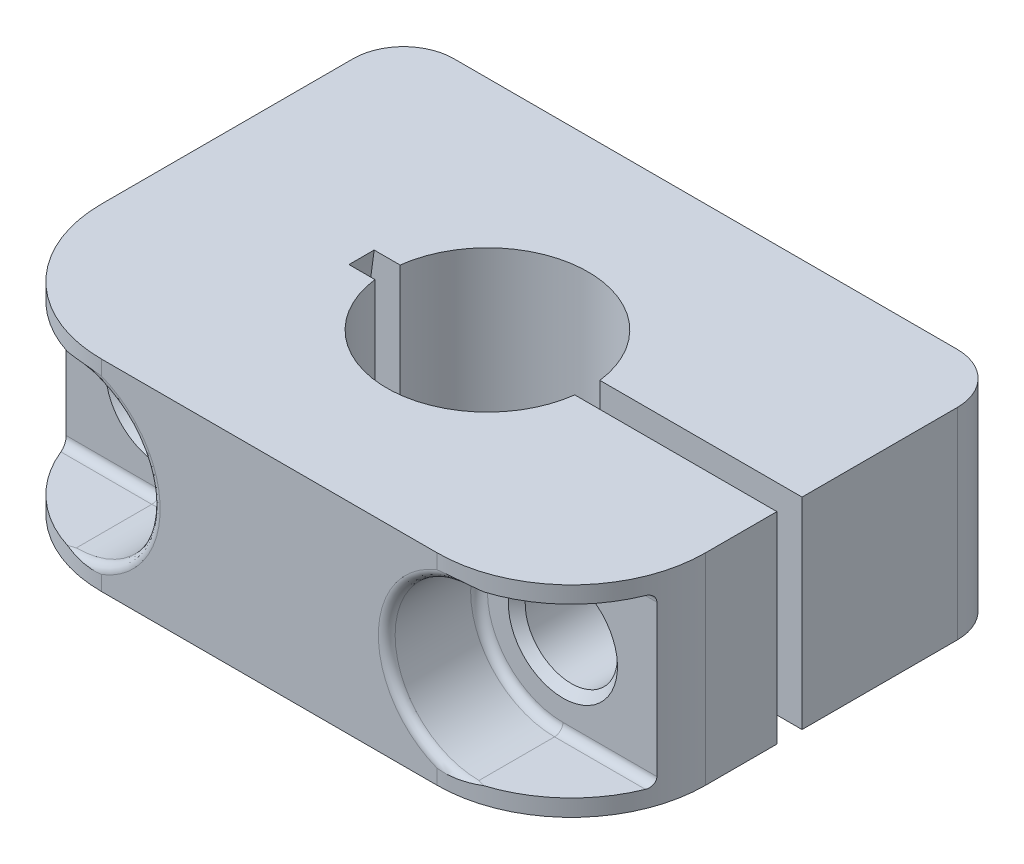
ISO-10303-21;
HEADER;
FILE_DESCRIPTION(('STEP AP214'),'2;1');
FILE_NAME('part.step','',(''),(''),'','','');
FILE_SCHEMA(('AUTOMOTIVE_DESIGN { 1 0 10303 214 1 1 1 1 }'));
ENDSEC;
DATA;
#1=APPLICATION_CONTEXT('core data for automotive mechanical design processes');
#2=APPLICATION_PROTOCOL_DEFINITION('international standard','automotive_design',2000,#1);
#3=PRODUCT_CONTEXT('',#1,'mechanical');
#4=PRODUCT('Part','Part','',(#3));
#5=PRODUCT_RELATED_PRODUCT_CATEGORY('part','',(#4));
#6=PRODUCT_DEFINITION_FORMATION('','',#4);
#7=PRODUCT_DEFINITION_CONTEXT('part definition',#1,'design');
#8=PRODUCT_DEFINITION('design','',#6,#7);
#9=PRODUCT_DEFINITION_SHAPE('','',#8);
#10=(LENGTH_UNIT() NAMED_UNIT(*) SI_UNIT(.MILLI.,.METRE.));
#11=(NAMED_UNIT(*) PLANE_ANGLE_UNIT() SI_UNIT($,.RADIAN.));
#12=(NAMED_UNIT(*) SI_UNIT($,.STERADIAN.) SOLID_ANGLE_UNIT());
#13=UNCERTAINTY_MEASURE_WITH_UNIT(LENGTH_MEASURE(1.E-05),#10,'distance_accuracy_value','');
#14=(GEOMETRIC_REPRESENTATION_CONTEXT(3) GLOBAL_UNCERTAINTY_ASSIGNED_CONTEXT((#13)) GLOBAL_UNIT_ASSIGNED_CONTEXT((#10,
#11,#12)) REPRESENTATION_CONTEXT('',''));
#15=CARTESIAN_POINT('',(0.,0.,0.));
#16=DIRECTION('',(0.,0.,1.));
#17=DIRECTION('',(1.,0.,0.));
#18=AXIS2_PLACEMENT_3D('',#15,#16,#17);
#19=CARTESIAN_POINT('',(44.0474398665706,0.,13.75));
#20=DIRECTION('',(0.,0.,1.));
#21=DIRECTION('',(0.,-1.,0.));
#22=AXIS2_PLACEMENT_3D('',#19,#20,#21);
#23=CYLINDRICAL_SURFACE('',#22,40.);
#24=DIRECTION('',(0.,0.,1.));
#25=VECTOR('',#24,1.);
#26=CARTESIAN_POINT('',(4.5,6.,13.75));
#27=LINE('',#26,#25);
#28=CARTESIAN_POINT('',(4.5,6.,13.75));
#29=VERTEX_POINT('',#28);
#30=CARTESIAN_POINT('',(4.5,6.,12.25));
#31=VERTEX_POINT('',#30);
#32=EDGE_CURVE('E412',#29,#31,#27,.F.);
#33=ORIENTED_EDGE('',*,*,#32,.F.);
#34=CARTESIAN_POINT('',(44.0474398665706,0.,13.75));
#35=DIRECTION('',(0.,0.,1.));
#36=DIRECTION('',(0.,-1.,0.));
#37=AXIS2_PLACEMENT_3D('',#34,#35,#36);
#38=CIRCLE('',#37,40.);
#39=CARTESIAN_POINT('',(4.5,-6.,13.75));
#40=VERTEX_POINT('',#39);
#41=EDGE_CURVE('E549',#29,#40,#38,.T.);
#42=ORIENTED_EDGE('',*,*,#41,.T.);
#43=DIRECTION('',(0.,0.,1.));
#44=VECTOR('',#43,1.);
#45=CARTESIAN_POINT('',(4.5,-6.,13.75));
#46=LINE('',#45,#44);
#47=CARTESIAN_POINT('',(4.5,-6.,12.25));
#48=VERTEX_POINT('',#47);
#49=EDGE_CURVE('E436',#48,#40,#46,.T.);
#50=ORIENTED_EDGE('',*,*,#49,.F.);
#51=CARTESIAN_POINT('',(44.0474398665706,0.,12.25));
#52=DIRECTION('',(0.,0.,1.));
#53=DIRECTION('',(0.,-1.,0.));
#54=AXIS2_PLACEMENT_3D('',#51,#52,#53);
#55=CIRCLE('',#54,40.);
#56=EDGE_CURVE('E554',#31,#48,#55,.T.);
#57=ORIENTED_EDGE('',*,*,#56,.F.);
#58=EDGE_LOOP('',(#33,#42,#50,#57));
#59=FACE_BOUND('',#58,.T.);
#60=ADVANCED_FACE('F14',(#59),#23,.F.);
#61=CARTESIAN_POINT('',(24.,0.,21.));
#62=DIRECTION('',(0.,0.,-1.));
#63=DIRECTION('',(0.,1.,0.));
#64=AXIS2_PLACEMENT_3D('',#61,#62,#63);
#65=TOROIDAL_SURFACE('',#64,4.5,0.500000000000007);
#66=CARTESIAN_POINT('',(24.,0.,20.5));
#67=DIRECTION('',(0.,0.,-1.));
#68=DIRECTION('',(0.,-1.,0.));
#69=AXIS2_PLACEMENT_3D('',#66,#67,#68);
#70=CIRCLE('',#69,4.5);
#71=CARTESIAN_POINT('',(24.,4.5,20.5));
#72=VERTEX_POINT('',#71);
#73=CARTESIAN_POINT('',(24.,-4.5,20.5));
#74=VERTEX_POINT('',#73);
#75=EDGE_CURVE('E229',#72,#74,#70,.F.);
#76=ORIENTED_EDGE('',*,*,#75,.F.);
#77=CARTESIAN_POINT('',(24.,4.5,21.));
#78=DIRECTION('',(1.,0.,0.));
#79=DIRECTION('',(0.,1.,0.));
#80=AXIS2_PLACEMENT_3D('',#77,#78,#79);
#81=CIRCLE('',#80,0.5);
#82=CARTESIAN_POINT('',(24.,5.,21.));
#83=VERTEX_POINT('',#82);
#84=EDGE_CURVE('E220',#72,#83,#81,.T.);
#85=ORIENTED_EDGE('',*,*,#84,.T.);
#86=CARTESIAN_POINT('',(24.,0.,21.));
#87=DIRECTION('',(0.,0.,1.));
#88=DIRECTION('',(0.,-1.,0.));
#89=AXIS2_PLACEMENT_3D('',#86,#87,#88);
#90=CIRCLE('',#89,5.);
#91=CARTESIAN_POINT('',(24.,-5.,21.));
#92=VERTEX_POINT('',#91);
#93=EDGE_CURVE('E427',#83,#92,#90,.T.);
#94=ORIENTED_EDGE('',*,*,#93,.T.);
#95=CARTESIAN_POINT('',(24.,-4.5,21.));
#96=DIRECTION('',(1.,0.,0.));
#97=DIRECTION('',(0.,1.,0.));
#98=AXIS2_PLACEMENT_3D('',#95,#96,#97);
#99=CIRCLE('',#98,0.5);
#100=EDGE_CURVE('E221',#92,#74,#99,.T.);
#101=ORIENTED_EDGE('',*,*,#100,.T.);
#102=EDGE_LOOP('',(#76,#85,#94,#101));
#103=FACE_BOUND('',#102,.T.);
#104=ADVANCED_FACE('F418',(#103),#65,.F.);
#105=CARTESIAN_POINT('',(36.,-4.5,21.));
#106=DIRECTION('',(1.,0.,0.));
#107=DIRECTION('',(0.,1.,0.));
#108=AXIS2_PLACEMENT_3D('',#105,#106,#107);
#109=CYLINDRICAL_SURFACE('',#108,0.5);
#110=DIRECTION('',(1.,0.,0.));
#111=VECTOR('',#110,1.);
#112=CARTESIAN_POINT('',(28.5,-4.5,20.5));
#113=LINE('',#112,#111);
#114=CARTESIAN_POINT('',(29.5993420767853,-4.5,20.5));
#115=VERTEX_POINT('',#114);
#116=EDGE_CURVE('E214',#74,#115,#113,.T.);
#117=ORIENTED_EDGE('',*,*,#116,.F.);
#118=ORIENTED_EDGE('',*,*,#100,.F.);
#119=DIRECTION('',(-1.,0.,0.));
#120=VECTOR('',#119,1.);
#121=CARTESIAN_POINT('',(36.,-5.,21.));
#122=LINE('',#121,#120);
#123=CARTESIAN_POINT('',(29.4161984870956,-5.,21.));
#124=VERTEX_POINT('',#123);
#125=EDGE_CURVE('E216',#124,#92,#122,.T.);
#126=ORIENTED_EDGE('',*,*,#125,.F.);
#127=CARTESIAN_POINT('',(29.5993420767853,-4.5,20.5));
#128=CARTESIAN_POINT('',(29.5993472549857,-4.52705093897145,20.4999717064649));
#129=CARTESIAN_POINT('',(29.5986204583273,-4.55408810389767,20.5021933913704));
#130=CARTESIAN_POINT('',(29.595743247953,-4.60733048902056,20.5109205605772));
#131=CARTESIAN_POINT('',(29.5935956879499,-4.63353726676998,20.5174174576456));
#132=CARTESIAN_POINT('',(29.587916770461,-4.6844308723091,20.5344811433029));
#133=CARTESIAN_POINT('',(29.5843853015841,-4.70911757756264,20.5450482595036));
#134=CARTESIAN_POINT('',(29.576010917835,-4.75631760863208,20.5698697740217));
#135=CARTESIAN_POINT('',(29.5711677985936,-4.77883059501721,20.584124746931));
#136=CARTESIAN_POINT('',(29.5601670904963,-4.82151617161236,20.616135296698));
#137=CARTESIAN_POINT('',(29.5539871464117,-4.84163860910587,20.6339499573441));
#138=CARTESIAN_POINT('',(29.540494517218,-4.8786076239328,20.6723315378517));
#139=CARTESIAN_POINT('',(29.5331816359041,-4.89545363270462,20.6928989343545));
#140=CARTESIAN_POINT('',(29.5171995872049,-4.92626394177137,20.7372047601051));
#141=CARTESIAN_POINT('',(29.5084824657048,-4.94005314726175,20.761047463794));
#142=CARTESIAN_POINT('',(29.4901540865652,-4.96345838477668,20.8103887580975));
#143=CARTESIAN_POINT('',(29.4805424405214,-4.97307259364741,20.8358880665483));
#144=CARTESIAN_POINT('',(29.4619351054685,-4.98703519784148,20.8844596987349));
#145=CARTESIAN_POINT('',(29.4530220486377,-4.9919060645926,20.9074159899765));
#146=CARTESIAN_POINT('',(29.4348426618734,-4.9983882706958,20.9535979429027));
#147=CARTESIAN_POINT('',(29.4255770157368,-5.00000562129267,20.9768230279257));
#148=CARTESIAN_POINT('',(29.4161984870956,-5.,21.));
#149=B_SPLINE_CURVE_WITH_KNOTS('',3,(#127,#128,#129,#130,#131,#132,#133,#134,#135,#136,#137,
#138,#139,#140,#141,#142,#143,#144,#145,#146,#147,#148),.UNSPECIFIED.,.F.,.F.,(4,2,2,2,2,2,2,2,
2,2,4),(0.,0.0810309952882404,0.161899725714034,0.242774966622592,0.323662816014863,
0.406025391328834,0.488402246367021,0.574695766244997,0.661026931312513,0.736122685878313,
0.811079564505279),.UNSPECIFIED.);
#150=EDGE_CURVE('E17',#115,#124,#149,.T.);
#151=ORIENTED_EDGE('',*,*,#150,.F.);
#152=EDGE_LOOP('',(#117,#118,#126,#151));
#153=FACE_BOUND('',#152,.T.);
#154=ADVANCED_FACE('F213',(#153),#109,.F.);
#155=CARTESIAN_POINT('',(36.,4.5,21.));
#156=DIRECTION('',(1.,0.,0.));
#157=DIRECTION('',(0.,1.,0.));
#158=AXIS2_PLACEMENT_3D('',#155,#156,#157);
#159=CYLINDRICAL_SURFACE('',#158,0.5);
#160=DIRECTION('',(1.,0.,0.));
#161=VECTOR('',#160,1.);
#162=CARTESIAN_POINT('',(36.,5.,21.));
#163=LINE('',#162,#161);
#164=CARTESIAN_POINT('',(29.4161984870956,5.,21.));
#165=VERTEX_POINT('',#164);
#166=EDGE_CURVE('E548',#83,#165,#163,.T.);
#167=ORIENTED_EDGE('',*,*,#166,.F.);
#168=ORIENTED_EDGE('',*,*,#84,.F.);
#169=DIRECTION('',(1.,0.,0.));
#170=VECTOR('',#169,1.);
#171=CARTESIAN_POINT('',(28.5,4.5,20.5));
#172=LINE('',#171,#170);
#173=CARTESIAN_POINT('',(29.5993420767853,4.5,20.5));
#174=VERTEX_POINT('',#173);
#175=EDGE_CURVE('E232',#174,#72,#172,.F.);
#176=ORIENTED_EDGE('',*,*,#175,.F.);
#177=CARTESIAN_POINT('',(29.4161984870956,5.,21.));
#178=CARTESIAN_POINT('',(29.428045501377,5.00001889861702,20.9707330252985));
#179=CARTESIAN_POINT('',(29.4397122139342,4.99743034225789,20.9413745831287));
#180=CARTESIAN_POINT('',(29.4624186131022,4.98707503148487,20.8832710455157));
#181=CARTESIAN_POINT('',(29.4734570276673,4.97929815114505,20.8545272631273));
#182=CARTESIAN_POINT('',(29.4946105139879,4.95858481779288,20.7985209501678));
#183=CARTESIAN_POINT('',(29.504723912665,4.9456392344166,20.7712611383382));
#184=CARTESIAN_POINT('',(29.5237304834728,4.91482971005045,20.719235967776));
#185=CARTESIAN_POINT('',(29.5326249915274,4.89697121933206,20.6944678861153));
#186=CARTESIAN_POINT('',(29.5485796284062,4.85770420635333,20.6494322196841));
#187=CARTESIAN_POINT('',(29.5557066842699,4.83650387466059,20.6290070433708));
#188=CARTESIAN_POINT('',(29.5684743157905,4.79055670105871,20.5920224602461));
#189=CARTESIAN_POINT('',(29.5741147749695,4.76580958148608,20.5754633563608));
#190=CARTESIAN_POINT('',(29.5834735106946,4.71510936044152,20.5477698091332));
#191=CARTESIAN_POINT('',(29.5872873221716,4.68931942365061,20.5363680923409));
#192=CARTESIAN_POINT('',(29.5933890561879,4.63604246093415,20.5180423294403));
#193=CARTESIAN_POINT('',(29.595679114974,4.60855787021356,20.5111120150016));
#194=CARTESIAN_POINT('',(29.5979030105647,4.56734483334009,20.5043710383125));
#195=CARTESIAN_POINT('',(29.59844279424,4.5539233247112,20.5027323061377));
#196=CARTESIAN_POINT('',(29.59916194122,4.52700352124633,20.5005476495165));
#197=CARTESIAN_POINT('',(29.5993418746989,4.51350538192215,20.4999999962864));
#198=CARTESIAN_POINT('',(29.5993420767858,4.5,20.5));
#199=B_SPLINE_CURVE_WITH_KNOTS('',3,(#177,#178,#179,#180,#181,#182,#183,#184,#185,#186,#187,
#188,#189,#190,#191,#192,#193,#194,#195,#196,#197,#198),.UNSPECIFIED.,.F.,.F.,(4,2,2,2,2,2,2,2,
2,2,4),(0.,0.0946423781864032,0.189470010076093,0.28446589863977,0.379356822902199,
0.469753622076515,0.560157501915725,0.64510008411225,0.729923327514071,0.770477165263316,
0.810966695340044),.UNSPECIFIED.);
#200=EDGE_CURVE('E236',#165,#174,#199,.T.);
#201=ORIENTED_EDGE('',*,*,#200,.F.);
#202=EDGE_LOOP('',(#167,#168,#176,#201));
#203=FACE_BOUND('',#202,.T.);
#204=ADVANCED_FACE('F665',(#203),#159,.F.);
#205=CARTESIAN_POINT('',(24.,0.,0.));
#206=DIRECTION('',(0.,0.,1.));
#207=DIRECTION('',(0.,-1.,0.));
#208=AXIS2_PLACEMENT_3D('',#205,#206,#207);
#209=CYLINDRICAL_SURFACE('',#208,5.);
#210=DIRECTION('',(0.,0.,1.));
#211=VECTOR('',#210,1.);
#212=CARTESIAN_POINT('',(24.,-5.,26.));
#213=LINE('',#212,#211);
#214=CARTESIAN_POINT('',(24.,-5.,25.5));
#215=VERTEX_POINT('',#214);
#216=EDGE_CURVE('E387',#92,#215,#213,.T.);
#217=ORIENTED_EDGE('',*,*,#216,.F.);
#218=ORIENTED_EDGE('',*,*,#93,.F.);
#219=DIRECTION('',(0.,0.,1.));
#220=VECTOR('',#219,1.);
#221=CARTESIAN_POINT('',(24.,5.,21.));
#222=LINE('',#221,#220);
#223=CARTESIAN_POINT('',(24.,5.,25.5));
#224=VERTEX_POINT('',#223);
#225=EDGE_CURVE('E394',#224,#83,#222,.F.);
#226=ORIENTED_EDGE('',*,*,#225,.F.);
#227=CARTESIAN_POINT('',(24.,0.,25.5));
#228=DIRECTION('',(0.,0.,-1.));
#229=DIRECTION('',(0.,1.,0.));
#230=AXIS2_PLACEMENT_3D('',#227,#228,#229);
#231=CIRCLE('',#230,5.);
#232=EDGE_CURVE('E707',#215,#224,#231,.T.);
#233=ORIENTED_EDGE('',*,*,#232,.F.);
#234=EDGE_LOOP('',(#217,#218,#226,#233));
#235=FACE_BOUND('',#234,.T.);
#236=ADVANCED_FACE('F669',(#235),#209,.F.);
#237=CARTESIAN_POINT('',(0.,0.,20.49999999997));
#238=DIRECTION('',(0.,0.,1.));
#239=DIRECTION('',(0.,-1.,0.));
#240=AXIS2_PLACEMENT_3D('',#237,#238,#239);
#241=CONICAL_SURFACE('',#240,3.2499999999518,0.785398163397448);
#242=CARTESIAN_POINT('',(0.,0.,20.49999999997));
#243=DIRECTION('',(0.,0.,1.));
#244=DIRECTION('',(0.,-1.,0.));
#245=AXIS2_PLACEMENT_3D('',#242,#243,#244);
#246=CIRCLE('',#245,3.2499999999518);
#247=CARTESIAN_POINT('',(0.,-3.2499999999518,20.49999999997));
#248=VERTEX_POINT('',#247);
#249=EDGE_CURVE('E540',#248,#248,#246,.F.);
#250=ORIENTED_EDGE('',*,*,#249,.F.);
#251=EDGE_LOOP('',(#250));
#252=FACE_BOUND('',#251,.T.);
#253=CARTESIAN_POINT('',(0.,0.,20.));
#254=DIRECTION('',(0.,0.,1.));
#255=DIRECTION('',(0.,-1.,0.));
#256=AXIS2_PLACEMENT_3D('',#253,#254,#255);
#257=CIRCLE('',#256,2.75);
#258=CARTESIAN_POINT('',(0.,-2.75,20.));
#259=VERTEX_POINT('',#258);
#260=EDGE_CURVE('E734',#259,#259,#257,.F.);
#261=ORIENTED_EDGE('',*,*,#260,.T.);
#262=EDGE_LOOP('',(#261));
#263=FACE_BOUND('',#262,.T.);
#264=ADVANCED_FACE('F673',(#252,#263),#241,.F.);
#265=CARTESIAN_POINT('',(0.,0.,21.));
#266=DIRECTION('',(0.,0.,-1.));
#267=DIRECTION('',(0.,1.,0.));
#268=AXIS2_PLACEMENT_3D('',#265,#266,#267);
#269=TOROIDAL_SURFACE('',#268,4.5,0.5);
#270=CARTESIAN_POINT('',(0.,4.5,21.));
#271=DIRECTION('',(-1.,0.,0.));
#272=DIRECTION('',(0.,-1.,0.));
#273=AXIS2_PLACEMENT_3D('',#270,#271,#272);
#274=CIRCLE('',#273,0.5);
#275=CARTESIAN_POINT('',(0.,5.,21.));
#276=VERTEX_POINT('',#275);
#277=CARTESIAN_POINT('',(0.,4.5,20.5));
#278=VERTEX_POINT('',#277);
#279=EDGE_CURVE('E566',#276,#278,#274,.T.);
#280=ORIENTED_EDGE('',*,*,#279,.T.);
#281=CARTESIAN_POINT('',(0.,0.,20.5));
#282=DIRECTION('',(0.,0.,-1.));
#283=DIRECTION('',(0.,1.,0.));
#284=AXIS2_PLACEMENT_3D('',#281,#282,#283);
#285=CIRCLE('',#284,4.5);
#286=CARTESIAN_POINT('',(0.,-4.5,20.5));
#287=VERTEX_POINT('',#286);
#288=EDGE_CURVE('E543',#287,#278,#285,.F.);
#289=ORIENTED_EDGE('',*,*,#288,.F.);
#290=CARTESIAN_POINT('',(0.,-4.5,21.));
#291=DIRECTION('',(-1.,0.,0.));
#292=DIRECTION('',(0.,-1.,0.));
#293=AXIS2_PLACEMENT_3D('',#290,#291,#292);
#294=CIRCLE('',#293,0.5);
#295=CARTESIAN_POINT('',(0.,-5.,21.));
#296=VERTEX_POINT('',#295);
#297=EDGE_CURVE('E567',#287,#296,#294,.T.);
#298=ORIENTED_EDGE('',*,*,#297,.T.);
#299=CARTESIAN_POINT('',(0.,0.,21.));
#300=DIRECTION('',(0.,0.,1.));
#301=DIRECTION('',(0.,-1.,0.));
#302=AXIS2_PLACEMENT_3D('',#299,#300,#301);
#303=CIRCLE('',#302,5.);
#304=EDGE_CURVE('E737',#296,#276,#303,.T.);
#305=ORIENTED_EDGE('',*,*,#304,.T.);
#306=EDGE_LOOP('',(#280,#289,#298,#305));
#307=FACE_BOUND('',#306,.T.);
#308=ADVANCED_FACE('F677',(#307),#269,.F.);
#309=CARTESIAN_POINT('',(-12.,-4.5,21.));
#310=DIRECTION('',(-1.,0.,0.));
#311=DIRECTION('',(0.,-1.,0.));
#312=AXIS2_PLACEMENT_3D('',#309,#310,#311);
#313=CYLINDRICAL_SURFACE('',#312,0.5);
#314=ORIENTED_EDGE('',*,*,#297,.F.);
#315=DIRECTION('',(1.,0.,0.));
#316=VECTOR('',#315,1.);
#317=CARTESIAN_POINT('',(4.5,-4.5,20.5));
#318=LINE('',#317,#316);
#319=CARTESIAN_POINT('',(-5.59934207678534,-4.5,20.5));
#320=VERTEX_POINT('',#319);
#321=EDGE_CURVE('E761',#320,#287,#318,.T.);
#322=ORIENTED_EDGE('',*,*,#321,.F.);
#323=CARTESIAN_POINT('',(-5.41619848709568,-5.,21.));
#324=CARTESIAN_POINT('',(-5.42804550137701,-5.00001889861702,20.9707330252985));
#325=CARTESIAN_POINT('',(-5.43971221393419,-4.99743034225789,20.9413745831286));
#326=CARTESIAN_POINT('',(-5.4624186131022,-4.98707503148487,20.8832710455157));
#327=CARTESIAN_POINT('',(-5.47345702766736,-4.97929815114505,20.8545272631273));
#328=CARTESIAN_POINT('',(-5.4946105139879,-4.95858481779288,20.7985209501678));
#329=CARTESIAN_POINT('',(-5.50472391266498,-4.94563923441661,20.7712611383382));
#330=CARTESIAN_POINT('',(-5.52373048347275,-4.91482971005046,20.719235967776));
#331=CARTESIAN_POINT('',(-5.53262499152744,-4.89697121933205,20.6944678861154));
#332=CARTESIAN_POINT('',(-5.54857962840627,-4.85770420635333,20.6494322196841));
#333=CARTESIAN_POINT('',(-5.55570668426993,-4.8365038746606,20.6290070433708));
#334=CARTESIAN_POINT('',(-5.56847431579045,-4.79055670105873,20.5920224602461));
#335=CARTESIAN_POINT('',(-5.57411477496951,-4.76580958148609,20.5754633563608));
#336=CARTESIAN_POINT('',(-5.58347351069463,-4.71510936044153,20.5477698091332));
#337=CARTESIAN_POINT('',(-5.58728732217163,-4.68931942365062,20.5363680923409));
#338=CARTESIAN_POINT('',(-5.59338905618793,-4.63604246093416,20.5180423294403));
#339=CARTESIAN_POINT('',(-5.59567911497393,-4.60855787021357,20.5111120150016));
#340=CARTESIAN_POINT('',(-5.59790301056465,-4.5673448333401,20.5043710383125));
#341=CARTESIAN_POINT('',(-5.59844279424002,-4.5539233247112,20.5027323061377));
#342=CARTESIAN_POINT('',(-5.59916194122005,-4.52700352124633,20.5005476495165));
#343=CARTESIAN_POINT('',(-5.59934187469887,-4.51350538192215,20.4999999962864));
#344=CARTESIAN_POINT('',(-5.59934207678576,-4.5,20.5));
#345=B_SPLINE_CURVE_WITH_KNOTS('',3,(#323,#324,#325,#326,#327,#328,#329,#330,#331,#332,#333,
#334,#335,#336,#337,#338,#339,#340,#341,#342,#343,#344),.UNSPECIFIED.,.F.,.F.,(4,2,2,2,2,2,2,2,
2,2,4),(0.,0.0946423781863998,0.189470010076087,0.284465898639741,0.379356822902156,
0.469753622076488,0.560157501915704,0.645100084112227,0.729923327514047,0.770477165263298,
0.810966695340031),.UNSPECIFIED.);
#346=CARTESIAN_POINT('',(-5.41619848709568,-5.,21.));
#347=VERTEX_POINT('',#346);
#348=EDGE_CURVE('E435',#347,#320,#345,.T.);
#349=ORIENTED_EDGE('',*,*,#348,.F.);
#350=DIRECTION('',(1.,0.,0.));
#351=VECTOR('',#350,1.);
#352=CARTESIAN_POINT('',(-12.,-5.,21.));
#353=LINE('',#352,#351);
#354=EDGE_CURVE('E785',#347,#296,#353,.T.);
#355=ORIENTED_EDGE('',*,*,#354,.T.);
#356=EDGE_LOOP('',(#314,#322,#349,#355));
#357=FACE_BOUND('',#356,.T.);
#358=ADVANCED_FACE('F682',(#357),#313,.F.);
#359=CARTESIAN_POINT('',(-12.,4.5,21.));
#360=DIRECTION('',(-1.,0.,0.));
#361=DIRECTION('',(0.,-1.,0.));
#362=AXIS2_PLACEMENT_3D('',#359,#360,#361);
#363=CYLINDRICAL_SURFACE('',#362,0.5);
#364=ORIENTED_EDGE('',*,*,#279,.F.);
#365=DIRECTION('',(-1.,0.,0.));
#366=VECTOR('',#365,1.);
#367=CARTESIAN_POINT('',(-12.,5.,21.));
#368=LINE('',#367,#366);
#369=CARTESIAN_POINT('',(-5.41619848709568,5.,21.));
#370=VERTEX_POINT('',#369);
#371=EDGE_CURVE('E760',#276,#370,#368,.T.);
#372=ORIENTED_EDGE('',*,*,#371,.T.);
#373=CARTESIAN_POINT('',(-5.59934207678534,4.5,20.5));
#374=CARTESIAN_POINT('',(-5.59934725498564,4.52705093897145,20.4999717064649));
#375=CARTESIAN_POINT('',(-5.59862045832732,4.55408810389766,20.5021933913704));
#376=CARTESIAN_POINT('',(-5.59574324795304,4.60733048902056,20.5109205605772));
#377=CARTESIAN_POINT('',(-5.59359568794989,4.63353726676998,20.5174174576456));
#378=CARTESIAN_POINT('',(-5.58791677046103,4.6844308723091,20.5344811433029));
#379=CARTESIAN_POINT('',(-5.58438530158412,4.70911757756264,20.5450482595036));
#380=CARTESIAN_POINT('',(-5.57601091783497,4.75631760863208,20.5698697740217));
#381=CARTESIAN_POINT('',(-5.57116779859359,4.77883059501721,20.584124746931));
#382=CARTESIAN_POINT('',(-5.5601670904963,4.82151617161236,20.616135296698));
#383=CARTESIAN_POINT('',(-5.55398714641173,4.84163860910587,20.6339499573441));
#384=CARTESIAN_POINT('',(-5.54049451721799,4.8786076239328,20.6723315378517));
#385=CARTESIAN_POINT('',(-5.53318163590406,4.89545363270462,20.6928989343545));
#386=CARTESIAN_POINT('',(-5.51719958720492,4.92626394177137,20.7372047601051));
#387=CARTESIAN_POINT('',(-5.50848246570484,4.94005314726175,20.761047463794));
#388=CARTESIAN_POINT('',(-5.49015408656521,4.96345838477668,20.8103887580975));
#389=CARTESIAN_POINT('',(-5.48054244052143,4.9730725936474,20.8358880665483));
#390=CARTESIAN_POINT('',(-5.46193510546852,4.98703519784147,20.8844596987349));
#391=CARTESIAN_POINT('',(-5.45302204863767,4.9919060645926,20.9074159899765));
#392=CARTESIAN_POINT('',(-5.43484266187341,4.9983882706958,20.9535979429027));
#393=CARTESIAN_POINT('',(-5.4255770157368,5.00000562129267,20.9768230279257));
#394=CARTESIAN_POINT('',(-5.41619848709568,5.,21.));
#395=B_SPLINE_CURVE_WITH_KNOTS('',3,(#373,#374,#375,#376,#377,#378,#379,#380,#381,#382,#383,
#384,#385,#386,#387,#388,#389,#390,#391,#392,#393,#394),.UNSPECIFIED.,.F.,.F.,(4,2,2,2,2,2,2,2,
2,2,4),(0.,0.0810309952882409,0.161899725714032,0.242774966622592,0.323662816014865,
0.406025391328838,0.488402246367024,0.574695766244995,0.661026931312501,0.736122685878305,
0.811079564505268),.UNSPECIFIED.);
#396=CARTESIAN_POINT('',(-5.59934207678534,4.5,20.5));
#397=VERTEX_POINT('',#396);
#398=EDGE_CURVE('E559',#397,#370,#395,.T.);
#399=ORIENTED_EDGE('',*,*,#398,.F.);
#400=DIRECTION('',(1.,0.,0.));
#401=VECTOR('',#400,1.);
#402=CARTESIAN_POINT('',(4.5,4.5,20.5));
#403=LINE('',#402,#401);
#404=EDGE_CURVE('E1002',#278,#397,#403,.F.);
#405=ORIENTED_EDGE('',*,*,#404,.F.);
#406=EDGE_LOOP('',(#364,#372,#399,#405));
#407=FACE_BOUND('',#406,.T.);
#408=ADVANCED_FACE('F573',(#407),#363,.F.);
#409=CARTESIAN_POINT('',(0.,0.,0.));
#410=DIRECTION('',(0.,0.,1.));
#411=DIRECTION('',(0.,-1.,0.));
#412=AXIS2_PLACEMENT_3D('',#409,#410,#411);
#413=CYLINDRICAL_SURFACE('',#412,5.);
#414=ORIENTED_EDGE('',*,*,#304,.F.);
#415=DIRECTION('',(0.,0.,1.));
#416=VECTOR('',#415,1.);
#417=CARTESIAN_POINT('',(0.,-5.,26.));
#418=LINE('',#417,#416);
#419=CARTESIAN_POINT('',(0.,-5.,25.5));
#420=VERTEX_POINT('',#419);
#421=EDGE_CURVE('E544',#296,#420,#418,.T.);
#422=ORIENTED_EDGE('',*,*,#421,.T.);
#423=CARTESIAN_POINT('',(0.,0.,25.5));
#424=DIRECTION('',(0.,0.,-1.));
#425=DIRECTION('',(0.,1.,0.));
#426=AXIS2_PLACEMENT_3D('',#423,#424,#425);
#427=CIRCLE('',#426,5.);
#428=CARTESIAN_POINT('',(0.,5.,25.5));
#429=VERTEX_POINT('',#428);
#430=EDGE_CURVE('E285',#429,#420,#427,.T.);
#431=ORIENTED_EDGE('',*,*,#430,.F.);
#432=DIRECTION('',(0.,0.,1.));
#433=VECTOR('',#432,1.);
#434=CARTESIAN_POINT('',(0.,5.,21.));
#435=LINE('',#434,#433);
#436=EDGE_CURVE('E757',#429,#276,#435,.F.);
#437=ORIENTED_EDGE('',*,*,#436,.T.);
#438=EDGE_LOOP('',(#414,#422,#431,#437));
#439=FACE_BOUND('',#438,.T.);
#440=ADVANCED_FACE('F961',(#439),#413,.F.);
#441=CARTESIAN_POINT('',(0.,0.,0.));
#442=DIRECTION('',(0.,0.,1.));
#443=DIRECTION('',(0.,-1.,0.));
#444=AXIS2_PLACEMENT_3D('',#441,#442,#443);
#445=CYLINDRICAL_SURFACE('',#444,2.75);
#446=ORIENTED_EDGE('',*,*,#260,.F.);
#447=EDGE_LOOP('',(#446));
#448=FACE_BOUND('',#447,.T.);
#449=CARTESIAN_POINT('',(0.,0.,0.50000000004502));
#450=DIRECTION('',(0.,0.,-1.));
#451=DIRECTION('',(0.,1.,0.));
#452=AXIS2_PLACEMENT_3D('',#449,#450,#451);
#453=CIRCLE('',#452,2.75000000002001);
#454=CARTESIAN_POINT('',(0.,2.75000000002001,0.50000000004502));
#455=VERTEX_POINT('',#454);
#456=EDGE_CURVE('E275',#455,#455,#453,.T.);
#457=ORIENTED_EDGE('',*,*,#456,.T.);
#458=EDGE_LOOP('',(#457));
#459=FACE_BOUND('',#458,.T.);
#460=ADVANCED_FACE('F953',(#448,#459),#445,.F.);
#461=CARTESIAN_POINT('',(44.0474398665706,0.,12.25));
#462=DIRECTION('',(0.,0.,1.));
#463=DIRECTION('',(0.,-1.,0.));
#464=AXIS2_PLACEMENT_3D('',#461,#462,#463);
#465=PLANE('',#464);
#466=DIRECTION('',(0.,-1.,0.));
#467=VECTOR('',#466,1.);
#468=CARTESIAN_POINT('',(6.04705955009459,6.000025,12.25));
#469=LINE('',#468,#467);
#470=CARTESIAN_POINT('',(6.04705955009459,6.,12.25));
#471=VERTEX_POINT('',#470);
#472=CARTESIAN_POINT('',(6.04705955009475,-6.,12.2499999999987));
#473=VERTEX_POINT('',#472);
#474=EDGE_CURVE('E920',#471,#473,#469,.T.);
#475=ORIENTED_EDGE('',*,*,#474,.F.);
#476=DIRECTION('',(1.,0.,0.));
#477=VECTOR('',#476,1.);
#478=CARTESIAN_POINT('',(44.0474398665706,6.,12.25));
#479=LINE('',#478,#477);
#480=EDGE_CURVE('E558',#471,#31,#479,.F.);
#481=ORIENTED_EDGE('',*,*,#480,.T.);
#482=ORIENTED_EDGE('',*,*,#56,.T.);
#483=DIRECTION('',(1.,0.,0.));
#484=VECTOR('',#483,1.);
#485=CARTESIAN_POINT('',(44.0474398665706,-6.,12.25));
#486=LINE('',#485,#484);
#487=EDGE_CURVE('E557',#48,#473,#486,.T.);
#488=ORIENTED_EDGE('',*,*,#487,.T.);
#489=EDGE_LOOP('',(#475,#481,#482,#488));
#490=FACE_BOUND('',#489,.T.);
#491=ADVANCED_FACE('F951',(#490),#465,.T.);
#492=CARTESIAN_POINT('',(44.0474398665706,0.,13.75));
#493=DIRECTION('',(0.,0.,1.));
#494=DIRECTION('',(0.,-1.,0.));
#495=AXIS2_PLACEMENT_3D('',#492,#493,#494);
#496=PLANE('',#495);
#497=DIRECTION('',(1.,0.,0.));
#498=VECTOR('',#497,1.);
#499=CARTESIAN_POINT('',(44.0474398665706,6.,13.75));
#500=LINE('',#499,#498);
#501=CARTESIAN_POINT('',(6.04705955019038,6.,13.75));
#502=VERTEX_POINT('',#501);
#503=EDGE_CURVE('E553',#502,#29,#500,.F.);
#504=ORIENTED_EDGE('',*,*,#503,.F.);
#505=DIRECTION('',(0.,-1.,0.));
#506=VECTOR('',#505,1.);
#507=CARTESIAN_POINT('',(6.04705955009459,6.000025,13.75));
#508=LINE('',#507,#506);
#509=CARTESIAN_POINT('',(6.04705955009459,-6.,13.75));
#510=VERTEX_POINT('',#509);
#511=EDGE_CURVE('E438',#502,#510,#508,.T.);
#512=ORIENTED_EDGE('',*,*,#511,.T.);
#513=DIRECTION('',(1.,0.,0.));
#514=VECTOR('',#513,1.);
#515=CARTESIAN_POINT('',(44.0474398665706,-6.,13.75));
#516=LINE('',#515,#514);
#517=EDGE_CURVE('E552',#40,#510,#516,.T.);
#518=ORIENTED_EDGE('',*,*,#517,.F.);
#519=ORIENTED_EDGE('',*,*,#41,.F.);
#520=EDGE_LOOP('',(#504,#512,#518,#519));
#521=FACE_BOUND('',#520,.T.);
#522=ADVANCED_FACE('F946',(#521),#496,.F.);
#523=CARTESIAN_POINT('',(24.,0.,20.49999999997));
#524=DIRECTION('',(0.,0.,1.));
#525=DIRECTION('',(0.,-1.,0.));
#526=AXIS2_PLACEMENT_3D('',#523,#524,#525);
#527=CONICAL_SURFACE('',#526,3.2499999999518,0.785398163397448);
#528=CARTESIAN_POINT('',(24.,0.,20.49999999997));
#529=DIRECTION('',(0.,0.,1.));
#530=DIRECTION('',(0.,-1.,0.));
#531=AXIS2_PLACEMENT_3D('',#528,#529,#530);
#532=CIRCLE('',#531,3.2499999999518);
#533=CARTESIAN_POINT('',(24.,-3.2499999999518,20.49999999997));
#534=VERTEX_POINT('',#533);
#535=EDGE_CURVE('E545',#534,#534,#532,.F.);
#536=ORIENTED_EDGE('',*,*,#535,.F.);
#537=EDGE_LOOP('',(#536));
#538=FACE_BOUND('',#537,.T.);
#539=CARTESIAN_POINT('',(24.,0.,20.));
#540=DIRECTION('',(0.,0.,1.));
#541=DIRECTION('',(0.,-1.,0.));
#542=AXIS2_PLACEMENT_3D('',#539,#540,#541);
#543=CIRCLE('',#542,2.75);
#544=CARTESIAN_POINT('',(24.,-2.75,20.));
#545=VERTEX_POINT('',#544);
#546=EDGE_CURVE('E259',#545,#545,#543,.F.);
#547=ORIENTED_EDGE('',*,*,#546,.T.);
#548=EDGE_LOOP('',(#547));
#549=FACE_BOUND('',#548,.T.);
#550=ADVANCED_FACE('F959',(#538,#549),#527,.F.);
#551=CARTESIAN_POINT('',(36.,-5.,26.));
#552=DIRECTION('',(0.,1.,0.));
#553=DIRECTION('',(-1.,0.,0.));
#554=AXIS2_PLACEMENT_3D('',#551,#552,#553);
#555=PLANE('',#554);
#556=ORIENTED_EDGE('',*,*,#216,.T.);
#557=CARTESIAN_POINT('',(24.409853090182,-5.,25.6284079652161));
#558=CARTESIAN_POINT('',(24.3927066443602,-5.00001168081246,25.6231803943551));
#559=CARTESIAN_POINT('',(24.3755676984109,-5.00001980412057,25.617928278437));
#560=CARTESIAN_POINT('',(24.341314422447,-5.00003075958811,25.6073844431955));
#561=CARTESIAN_POINT('',(24.3242000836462,-5.00003359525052,25.6020927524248));
#562=CARTESIAN_POINT('',(24.2899926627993,-5.00003580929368,25.591475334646));
#563=CARTESIAN_POINT('',(24.2728995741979,-5.00003518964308,25.5861496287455));
#564=CARTESIAN_POINT('',(24.2387312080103,-5.00003198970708,25.5754698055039));
#565=CARTESIAN_POINT('',(24.2216559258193,-5.00002941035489,25.5701157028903));
#566=CARTESIAN_POINT('',(24.1875196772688,-5.00002353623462,25.5593847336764));
#567=CARTESIAN_POINT('',(24.170458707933,-5.00002024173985,25.5540078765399));
#568=CARTESIAN_POINT('',(24.1363475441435,-5.00001389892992,25.5432370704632));
#569=CARTESIAN_POINT('',(24.1192973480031,-5.00001085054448,25.5378431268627));
#570=CARTESIAN_POINT('',(24.0852041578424,-5.00000570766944,25.5270438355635));
#571=CARTESIAN_POINT('',(24.0681611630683,-5.00000361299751,25.5216384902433));
#572=CARTESIAN_POINT('',(24.0340787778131,-5.00000073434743,25.5108220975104));
#573=CARTESIAN_POINT('',(24.017039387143,-4.99999995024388,25.505411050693));
#574=CARTESIAN_POINT('',(24.,-5.,25.5));
#575=B_SPLINE_CURVE_WITH_KNOTS('',3,(#557,#558,#559,#560,#561,#562,#563,#564,#565,#566,#567,
#568,#569,#570,#571,#572,#573,#574),.UNSPECIFIED.,.F.,.F.,(4,2,2,2,2,2,2,2,4),(0.,
0.0537768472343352,0.107518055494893,0.161228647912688,0.214913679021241,0.268578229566,
0.322227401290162,0.375866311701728,0.42950008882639),.UNSPECIFIED.);
#576=CARTESIAN_POINT('',(24.4098530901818,-5.,25.6284079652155));
#577=VERTEX_POINT('',#576);
#578=EDGE_CURVE('E382',#577,#215,#575,.T.);
#579=ORIENTED_EDGE('',*,*,#578,.F.);
#580=CARTESIAN_POINT('',(22.,-5.,18.));
#581=DIRECTION('',(0.,-1.,0.));
#582=DIRECTION('',(1.,0.,0.));
#583=AXIS2_PLACEMENT_3D('',#580,#581,#582);
#584=CIRCLE('',#583,8.);
#585=EDGE_CURVE('E531',#124,#577,#584,.T.);
#586=ORIENTED_EDGE('',*,*,#585,.F.);
#587=ORIENTED_EDGE('',*,*,#125,.T.);
#588=EDGE_LOOP('',(#556,#579,#586,#587));
#589=FACE_BOUND('',#588,.T.);
#590=ADVANCED_FACE('F361',(#589),#555,.T.);
#591=CARTESIAN_POINT('',(36.,5.,21.));
#592=DIRECTION('',(0.,-1.,0.));
#593=DIRECTION('',(1.,0.,0.));
#594=AXIS2_PLACEMENT_3D('',#591,#592,#593);
#595=PLANE('',#594);
#596=ORIENTED_EDGE('',*,*,#225,.T.);
#597=ORIENTED_EDGE('',*,*,#166,.T.);
#598=CARTESIAN_POINT('',(22.,5.,18.));
#599=DIRECTION('',(0.,-1.,0.));
#600=DIRECTION('',(1.,0.,0.));
#601=AXIS2_PLACEMENT_3D('',#598,#599,#600);
#602=CIRCLE('',#601,8.);
#603=CARTESIAN_POINT('',(24.4098530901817,5.,25.6284079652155));
#604=VERTEX_POINT('',#603);
#605=EDGE_CURVE('E239',#604,#165,#602,.F.);
#606=ORIENTED_EDGE('',*,*,#605,.F.);
#607=CARTESIAN_POINT('',(24.,5.,25.5));
#608=CARTESIAN_POINT('',(24.017039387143,4.99999995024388,25.505411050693));
#609=CARTESIAN_POINT('',(24.0340787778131,5.00000073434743,25.5108220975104));
#610=CARTESIAN_POINT('',(24.0681611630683,5.00000361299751,25.5216384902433));
#611=CARTESIAN_POINT('',(24.0852041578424,5.00000570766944,25.5270438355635));
#612=CARTESIAN_POINT('',(24.1192973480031,5.00001085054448,25.5378431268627));
#613=CARTESIAN_POINT('',(24.1363475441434,5.00001389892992,25.5432370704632));
#614=CARTESIAN_POINT('',(24.170458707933,5.00002024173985,25.5540078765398));
#615=CARTESIAN_POINT('',(24.1875196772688,5.00002353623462,25.5593847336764));
#616=CARTESIAN_POINT('',(24.2216559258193,5.00002941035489,25.5701157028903));
#617=CARTESIAN_POINT('',(24.2387312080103,5.00003198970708,25.5754698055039));
#618=CARTESIAN_POINT('',(24.2728995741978,5.00003518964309,25.5861496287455));
#619=CARTESIAN_POINT('',(24.2899926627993,5.00003580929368,25.591475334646));
#620=CARTESIAN_POINT('',(24.3242000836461,5.00003359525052,25.6020927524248));
#621=CARTESIAN_POINT('',(24.3413144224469,5.00003075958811,25.6073844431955));
#622=CARTESIAN_POINT('',(24.3755676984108,5.00001980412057,25.617928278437));
#623=CARTESIAN_POINT('',(24.3927066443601,5.00001168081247,25.6231803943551));
#624=CARTESIAN_POINT('',(24.4098530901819,5.00000000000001,25.6284079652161));
#625=B_SPLINE_CURVE_WITH_KNOTS('',3,(#607,#608,#609,#610,#611,#612,#613,#614,#615,#616,#617,
#618,#619,#620,#621,#622,#623,#624),.UNSPECIFIED.,.F.,.F.,(4,2,2,2,2,2,2,2,4),(0.,
0.0536337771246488,0.107272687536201,0.160921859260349,0.214586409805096,0.268271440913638,
0.321982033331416,0.375723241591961,0.429500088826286),.UNSPECIFIED.);
#626=EDGE_CURVE('E703',#224,#604,#625,.T.);
#627=ORIENTED_EDGE('',*,*,#626,.F.);
#628=EDGE_LOOP('',(#596,#597,#606,#627));
#629=FACE_BOUND('',#628,.T.);
#630=ADVANCED_FACE('F354',(#629),#595,.T.);
#631=CARTESIAN_POINT('',(28.5,0.,20.5));
#632=DIRECTION('',(0.,0.,1.));
#633=DIRECTION('',(0.,-1.,0.));
#634=AXIS2_PLACEMENT_3D('',#631,#632,#633);
#635=PLANE('',#634);
#636=DIRECTION('',(0.,-1.,0.));
#637=VECTOR('',#636,1.);
#638=CARTESIAN_POINT('',(29.5993420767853,-6.,20.5));
#639=LINE('',#638,#637);
#640=EDGE_CURVE('E227',#174,#115,#639,.T.);
#641=ORIENTED_EDGE('',*,*,#640,.F.);
#642=ORIENTED_EDGE('',*,*,#175,.T.);
#643=ORIENTED_EDGE('',*,*,#75,.T.);
#644=ORIENTED_EDGE('',*,*,#116,.T.);
#645=EDGE_LOOP('',(#641,#642,#643,#644));
#646=FACE_BOUND('',#645,.T.);
#647=ORIENTED_EDGE('',*,*,#535,.T.);
#648=EDGE_LOOP('',(#647));
#649=FACE_BOUND('',#648,.T.);
#650=ADVANCED_FACE('F224',(#646,#649),#635,.T.);
#651=CARTESIAN_POINT('',(24.,0.,25.5));
#652=DIRECTION('',(0.,0.,-1.));
#653=DIRECTION('',(0.,1.,0.));
#654=AXIS2_PLACEMENT_3D('',#651,#652,#653);
#655=TOROIDAL_SURFACE('',#654,5.5,0.5);
#656=CARTESIAN_POINT('',(24.4098530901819,5.00000000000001,25.6284079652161));
#657=CARTESIAN_POINT('',(24.3494206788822,5.01005644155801,25.6474902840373));
#658=CARTESIAN_POINT('',(24.2887379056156,5.02000782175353,25.6658494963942));
#659=CARTESIAN_POINT('',(24.1522471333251,5.04178578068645,25.7053682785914));
#660=CARTESIAN_POINT('',(24.0763071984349,5.05348862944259,25.7261412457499));
#661=CARTESIAN_POINT('',(23.9515295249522,5.07165729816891,25.7583166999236));
#662=CARTESIAN_POINT('',(23.9029108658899,5.07847618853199,25.7703731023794));
#663=CARTESIAN_POINT('',(23.7944749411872,5.09301585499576,25.7962063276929));
#664=CARTESIAN_POINT('',(23.7345864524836,5.10059696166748,25.8097643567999));
#665=CARTESIAN_POINT('',(23.6087761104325,5.11540790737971,25.8367356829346));
#666=CARTESIAN_POINT('',(23.542814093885,5.12253849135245,25.8500167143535));
#667=CARTESIAN_POINT('',(23.4046191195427,5.13594978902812,25.8760219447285));
#668=CARTESIAN_POINT('',(23.3323447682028,5.14210063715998,25.8885944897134));
#669=CARTESIAN_POINT('',(23.1769809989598,5.15317494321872,25.9133760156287));
#670=CARTESIAN_POINT('',(23.0938205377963,5.15779784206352,25.9252768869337));
#671=CARTESIAN_POINT('',(22.9149782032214,5.16471029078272,25.9480178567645));
#672=CARTESIAN_POINT('',(22.8192272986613,5.16656490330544,25.9584546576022));
#673=CARTESIAN_POINT('',(22.6377478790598,5.16626387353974,25.9749471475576));
#674=CARTESIAN_POINT('',(22.5520507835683,5.16451868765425,25.9813536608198));
#675=CARTESIAN_POINT('',(22.3972612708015,5.15815046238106,25.9904110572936));
#676=CARTESIAN_POINT('',(22.3281717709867,5.1541511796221,25.9935493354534));
#677=CARTESIAN_POINT('',(22.2071798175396,5.14498718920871,25.9974772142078));
#678=CARTESIAN_POINT('',(22.1552491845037,5.14035469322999,25.9986555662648));
#679=CARTESIAN_POINT('',(22.0688909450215,5.13148383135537,25.9997755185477));
#680=CARTESIAN_POINT('',(22.0344267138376,5.12763315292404,25.9999991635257));
#681=CARTESIAN_POINT('',(22.,5.1234753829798,26.));
#682=B_SPLINE_CURVE_WITH_KNOTS('',3,(#656,#657,#658,#659,#660,#661,#662,#663,#664,#665,#666,
#667,#668,#669,#670,#671,#672,#673,#674,#675,#676,#677,#678,#679,#680,#681),.UNSPECIFIED.,.F.,
.F.,(4,2,2,2,2,2,2,2,2,2,2,2,4),(0.,0.192503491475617,0.431246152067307,0.582895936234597,
0.768483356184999,0.971437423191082,1.19223772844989,1.44455800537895,1.7334238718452,
1.99117375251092,2.19893674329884,2.35535850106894,2.45938825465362),.UNSPECIFIED.);
#683=CARTESIAN_POINT('',(22.,5.1234753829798,26.));
#684=VERTEX_POINT('',#683);
#685=EDGE_CURVE('E244',#684,#604,#682,.F.);
#686=ORIENTED_EDGE('',*,*,#685,.F.);
#687=CARTESIAN_POINT('',(24.,0.,26.));
#688=DIRECTION('',(0.,0.,1.));
#689=DIRECTION('',(-0.363636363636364,0.9315409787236,0.));
#690=AXIS2_PLACEMENT_3D('',#687,#688,#689);
#691=CIRCLE('',#690,5.5);
#692=CARTESIAN_POINT('',(22.,-5.1234753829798,26.));
#693=VERTEX_POINT('',#692);
#694=EDGE_CURVE('E625',#684,#693,#691,.T.);
#695=ORIENTED_EDGE('',*,*,#694,.T.);
#696=CARTESIAN_POINT('',(22.,-5.1234753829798,26.));
#697=CARTESIAN_POINT('',(22.0689275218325,-5.1317641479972,26.0000032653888));
#698=CARTESIAN_POINT('',(22.1380064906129,-5.13874098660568,25.9990975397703));
#699=CARTESIAN_POINT('',(22.2759483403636,-5.15019601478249,25.9954755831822));
#700=CARTESIAN_POINT('',(22.344810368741,-5.15468751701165,25.9927691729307));
#701=CARTESIAN_POINT('',(22.482179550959,-5.16136539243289,25.9855726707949));
#702=CARTESIAN_POINT('',(22.5506866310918,-5.1635639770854,25.9810922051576));
#703=CARTESIAN_POINT('',(22.6872416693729,-5.16586709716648,25.9704049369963));
#704=CARTESIAN_POINT('',(22.7552901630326,-5.16598245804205,25.9642072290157));
#705=CARTESIAN_POINT('',(22.8908465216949,-5.16429796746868,25.9501374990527));
#706=CARTESIAN_POINT('',(22.9583553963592,-5.1625075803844,25.9422739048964));
#707=CARTESIAN_POINT('',(23.0928008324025,-5.15730608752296,25.9250272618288));
#708=CARTESIAN_POINT('',(23.159738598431,-5.1539024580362,25.915651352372));
#709=CARTESIAN_POINT('',(23.2841738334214,-5.14588476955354,25.8965851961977));
#710=CARTESIAN_POINT('',(23.3417187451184,-5.14149788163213,25.8871105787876));
#711=CARTESIAN_POINT('',(23.4660076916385,-5.13059017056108,25.8650761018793));
#712=CARTESIAN_POINT('',(23.5326864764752,-5.12383555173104,25.8522652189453));
#713=CARTESIAN_POINT('',(23.6748924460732,-5.10802624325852,25.8230840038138));
#714=CARTESIAN_POINT('',(23.7503471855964,-5.0987817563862,25.8064664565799));
#715=CARTESIAN_POINT('',(23.8982330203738,-5.07927013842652,25.7717503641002));
#716=CARTESIAN_POINT('',(23.9706844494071,-5.06904443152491,25.7537150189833));
#717=CARTESIAN_POINT('',(24.1078938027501,-5.04863983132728,25.7175146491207));
#718=CARTESIAN_POINT('',(24.1727140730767,-5.0385532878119,25.6995331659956));
#719=CARTESIAN_POINT('',(24.295010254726,-5.01897312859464,25.66394333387));
#720=CARTESIAN_POINT('',(24.3525406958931,-5.00952894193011,25.6464951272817));
#721=CARTESIAN_POINT('',(24.409853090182,-5.,25.6284079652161));
#722=B_SPLINE_CURVE_WITH_KNOTS('',3,(#696,#697,#698,#699,#700,#701,#702,#703,#704,#705,#706,
#707,#708,#709,#710,#711,#712,#713,#714,#715,#716,#717,#718,#719,#720,#721),.UNSPECIFIED.,.F.,
.F.,(4,2,2,2,2,2,2,2,2,2,2,2,4),(0.,0.208244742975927,0.415362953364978,0.621372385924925,
0.826310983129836,1.03023653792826,1.23322614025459,1.40864725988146,1.61330465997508,
1.84670378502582,2.07274530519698,2.27678193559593,2.45933033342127),.UNSPECIFIED.);
#723=EDGE_CURVE('E530',#577,#693,#722,.F.);
#724=ORIENTED_EDGE('',*,*,#723,.F.);
#725=ORIENTED_EDGE('',*,*,#578,.T.);
#726=ORIENTED_EDGE('',*,*,#232,.T.);
#727=ORIENTED_EDGE('',*,*,#626,.T.);
#728=EDGE_LOOP('',(#686,#695,#724,#725,#726,#727));
#729=FACE_BOUND('',#728,.T.);
#730=ADVANCED_FACE('F353',(#729),#655,.T.);
#731=CARTESIAN_POINT('',(-12.,-5.,26.));
#732=DIRECTION('',(0.,-1.,0.));
#733=DIRECTION('',(1.,0.,0.));
#734=AXIS2_PLACEMENT_3D('',#731,#732,#733);
#735=PLANE('',#734);
#736=ORIENTED_EDGE('',*,*,#421,.F.);
#737=ORIENTED_EDGE('',*,*,#354,.F.);
#738=CARTESIAN_POINT('',(2.,-5.,18.));
#739=DIRECTION('',(0.,-1.,0.));
#740=DIRECTION('',(1.,0.,0.));
#741=AXIS2_PLACEMENT_3D('',#738,#739,#740);
#742=CIRCLE('',#741,8.);
#743=CARTESIAN_POINT('',(-0.409853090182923,-5.,25.6284079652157));
#744=VERTEX_POINT('',#743);
#745=EDGE_CURVE('E520',#744,#347,#742,.T.);
#746=ORIENTED_EDGE('',*,*,#745,.F.);
#747=CARTESIAN_POINT('',(0.,-4.99999999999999,25.5));
#748=CARTESIAN_POINT('',(-0.0170393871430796,-4.99999995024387,25.5054110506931));
#749=CARTESIAN_POINT('',(-0.0340787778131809,-5.00000073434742,25.5108220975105));
#750=CARTESIAN_POINT('',(-0.0681611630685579,-5.0000036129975,25.5216384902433));
#751=CARTESIAN_POINT('',(-0.0852041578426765,-5.00000570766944,25.5270438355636));
#752=CARTESIAN_POINT('',(-0.119297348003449,-5.00001085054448,25.5378431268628));
#753=CARTESIAN_POINT('',(-0.136347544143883,-5.00001389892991,25.5432370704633));
#754=CARTESIAN_POINT('',(-0.170458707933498,-5.00002024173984,25.55400787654));
#755=CARTESIAN_POINT('',(-0.187519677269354,-5.00002353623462,25.5593847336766));
#756=CARTESIAN_POINT('',(-0.221655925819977,-5.00002941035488,25.5701157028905));
#757=CARTESIAN_POINT('',(-0.238731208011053,-5.00003198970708,25.5754698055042));
#758=CARTESIAN_POINT('',(-0.272899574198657,-5.00003518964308,25.5861496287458));
#759=CARTESIAN_POINT('',(-0.289992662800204,-5.00003580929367,25.5914753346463));
#760=CARTESIAN_POINT('',(-0.324200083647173,-5.00003359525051,25.6020927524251));
#761=CARTESIAN_POINT('',(-0.341314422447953,-5.0000307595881,25.6073844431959));
#762=CARTESIAN_POINT('',(-0.375567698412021,-5.00001980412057,25.6179282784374));
#763=CARTESIAN_POINT('',(-0.392706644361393,-5.00001168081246,25.6231803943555));
#764=CARTESIAN_POINT('',(-0.409853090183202,-5.,25.6284079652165));
#765=B_SPLINE_CURVE_WITH_KNOTS('',3,(#747,#748,#749,#750,#751,#752,#753,#754,#755,#756,#757,
#758,#759,#760,#761,#762,#763,#764),.UNSPECIFIED.,.F.,.F.,(4,2,2,2,2,2,2,2,4),(0.,
0.0536337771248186,0.107272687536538,0.160921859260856,0.214586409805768,0.268271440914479,
0.321982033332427,0.375723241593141,0.429500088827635),.UNSPECIFIED.);
#766=EDGE_CURVE('E775',#420,#744,#765,.T.);
#767=ORIENTED_EDGE('',*,*,#766,.F.);
#768=EDGE_LOOP('',(#736,#737,#746,#767));
#769=FACE_BOUND('',#768,.T.);
#770=ADVANCED_FACE('F783',(#769),#735,.F.);
#771=CARTESIAN_POINT('',(4.5,0.,20.5));
#772=DIRECTION('',(0.,0.,1.));
#773=DIRECTION('',(0.,-1.,0.));
#774=AXIS2_PLACEMENT_3D('',#771,#772,#773);
#775=PLANE('',#774);
#776=DIRECTION('',(0.,-1.,0.));
#777=VECTOR('',#776,1.);
#778=CARTESIAN_POINT('',(-5.59934207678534,-6.,20.5));
#779=LINE('',#778,#777);
#780=EDGE_CURVE('E517',#320,#397,#779,.F.);
#781=ORIENTED_EDGE('',*,*,#780,.F.);
#782=ORIENTED_EDGE('',*,*,#321,.T.);
#783=ORIENTED_EDGE('',*,*,#288,.T.);
#784=ORIENTED_EDGE('',*,*,#404,.T.);
#785=EDGE_LOOP('',(#781,#782,#783,#784));
#786=FACE_BOUND('',#785,.T.);
#787=ORIENTED_EDGE('',*,*,#249,.T.);
#788=EDGE_LOOP('',(#787));
#789=FACE_BOUND('',#788,.T.);
#790=ADVANCED_FACE('F823',(#786,#789),#775,.T.);
#791=CARTESIAN_POINT('',(-12.,5.,21.));
#792=DIRECTION('',(0.,1.,0.));
#793=DIRECTION('',(-1.,0.,0.));
#794=AXIS2_PLACEMENT_3D('',#791,#792,#793);
#795=PLANE('',#794);
#796=ORIENTED_EDGE('',*,*,#436,.F.);
#797=CARTESIAN_POINT('',(-0.409853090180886,5.,25.6284079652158));
#798=CARTESIAN_POINT('',(-0.392706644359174,5.00001168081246,25.6231803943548));
#799=CARTESIAN_POINT('',(-0.375567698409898,5.00001980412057,25.6179282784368));
#800=CARTESIAN_POINT('',(-0.341314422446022,5.00003075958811,25.6073844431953));
#801=CARTESIAN_POINT('',(-0.324200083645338,5.00003359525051,25.6020927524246));
#802=CARTESIAN_POINT('',(-0.289992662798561,5.00003580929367,25.5914753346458));
#803=CARTESIAN_POINT('',(-0.27289957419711,5.00003518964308,25.5861496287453));
#804=CARTESIAN_POINT('',(-0.238731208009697,5.00003198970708,25.5754698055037));
#805=CARTESIAN_POINT('',(-0.221655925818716,5.00002941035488,25.5701157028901));
#806=CARTESIAN_POINT('',(-0.187519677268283,5.00002353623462,25.5593847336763));
#807=CARTESIAN_POINT('',(-0.170458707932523,5.00002024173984,25.5540078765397));
#808=CARTESIAN_POINT('',(-0.136347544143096,5.00001389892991,25.5432370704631));
#809=CARTESIAN_POINT('',(-0.119297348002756,5.00001085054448,25.5378431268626));
#810=CARTESIAN_POINT('',(-0.0852041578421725,5.00000570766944,25.5270438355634));
#811=CARTESIAN_POINT('',(-0.0681611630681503,5.0000036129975,25.5216384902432));
#812=CARTESIAN_POINT('',(-0.0340787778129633,5.00000073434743,25.5108220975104));
#813=CARTESIAN_POINT('',(-0.0170393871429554,4.99999995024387,25.505411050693));
#814=CARTESIAN_POINT('',(0.,4.99999999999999,25.5));
#815=B_SPLINE_CURVE_WITH_KNOTS('',3,(#797,#798,#799,#800,#801,#802,#803,#804,#805,#806,#807,
#808,#809,#810,#811,#812,#813,#814),.UNSPECIFIED.,.F.,.F.,(4,2,2,2,2,2,2,2,4),(0.,
0.0537768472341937,0.107518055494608,0.161228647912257,0.214913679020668,0.268578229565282,
0.322227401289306,0.375866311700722,0.429500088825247),.UNSPECIFIED.);
#816=CARTESIAN_POINT('',(-0.409853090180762,5.,25.6284079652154));
#817=VERTEX_POINT('',#816);
#818=EDGE_CURVE('E744',#817,#429,#815,.T.);
#819=ORIENTED_EDGE('',*,*,#818,.F.);
#820=CARTESIAN_POINT('',(2.,5.,18.));
#821=DIRECTION('',(0.,-1.,0.));
#822=DIRECTION('',(1.,0.,0.));
#823=AXIS2_PLACEMENT_3D('',#820,#821,#822);
#824=CIRCLE('',#823,8.);
#825=EDGE_CURVE('E514',#370,#817,#824,.F.);
#826=ORIENTED_EDGE('',*,*,#825,.F.);
#827=ORIENTED_EDGE('',*,*,#371,.F.);
#828=EDGE_LOOP('',(#796,#819,#826,#827));
#829=FACE_BOUND('',#828,.T.);
#830=ADVANCED_FACE('F304',(#829),#795,.F.);
#831=CARTESIAN_POINT('',(0.,0.,25.5));
#832=DIRECTION('',(0.,0.,-1.));
#833=DIRECTION('',(0.,1.,0.));
#834=AXIS2_PLACEMENT_3D('',#831,#832,#833);
#835=TOROIDAL_SURFACE('',#834,5.5,0.500000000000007);
#836=ORIENTED_EDGE('',*,*,#818,.T.);
#837=ORIENTED_EDGE('',*,*,#430,.T.);
#838=ORIENTED_EDGE('',*,*,#766,.T.);
#839=CARTESIAN_POINT('',(-0.409853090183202,-5.,25.6284079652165));
#840=CARTESIAN_POINT('',(-0.361720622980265,-5.00800402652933,25.6435983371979));
#841=CARTESIAN_POINT('',(-0.313427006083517,-5.01593859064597,25.6583146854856));
#842=CARTESIAN_POINT('',(-0.210205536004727,-5.0325644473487,25.688692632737));
#843=CARTESIAN_POINT('',(-0.155234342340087,-5.04121937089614,25.704226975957));
#844=CARTESIAN_POINT('',(-0.0384258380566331,-5.05900465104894,25.7359324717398));
#845=CARTESIAN_POINT('',(0.0234591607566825,-5.06807134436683,25.7519639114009));
#846=CARTESIAN_POINT('',(0.154383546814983,-5.08628901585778,25.7842496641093));
#847=CARTESIAN_POINT('',(0.223476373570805,-5.09534412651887,25.8003424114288));
#848=CARTESIAN_POINT('',(0.369145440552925,-5.11297356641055,25.8322378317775));
#849=CARTESIAN_POINT('',(0.445779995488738,-5.12140959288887,25.8478510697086));
#850=CARTESIAN_POINT('',(0.606878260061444,-5.13709780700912,25.8782143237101));
#851=CARTESIAN_POINT('',(0.691402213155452,-5.1441647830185,25.8927460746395));
#852=CARTESIAN_POINT('',(0.810616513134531,-5.15206140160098,25.911155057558));
#853=CARTESIAN_POINT('',(0.845046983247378,-5.15410091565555,25.9162287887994));
#854=CARTESIAN_POINT('',(0.946857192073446,-5.15945796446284,25.9305693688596));
#855=CARTESIAN_POINT('',(1.01435824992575,-5.16214040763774,25.9392226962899));
#856=CARTESIAN_POINT('',(1.18345367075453,-5.16648740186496,25.9587303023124));
#857=CARTESIAN_POINT('',(1.28520821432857,-5.16697115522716,25.9685195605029));
#858=CARTESIAN_POINT('',(1.45982106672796,-5.16372490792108,25.9819638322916));
#859=CARTESIAN_POINT('',(1.53263089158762,-5.16115908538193,25.9865723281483));
#860=CARTESIAN_POINT('',(1.67364505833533,-5.15372246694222,25.9935720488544));
#861=CARTESIAN_POINT('',(1.74185134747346,-5.14900661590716,25.9960843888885));
#862=CARTESIAN_POINT('',(1.87340669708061,-5.13760839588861,25.9992412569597));
#863=CARTESIAN_POINT('',(1.93676672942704,-5.13108385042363,26.000002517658));
#864=CARTESIAN_POINT('',(2.00000000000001,-5.12347538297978,26.));
#865=B_SPLINE_CURVE_WITH_KNOTS('',3,(#839,#840,#841,#842,#843,#844,#845,#846,#847,#848,#849,
#850,#851,#852,#853,#854,#855,#856,#857,#858,#859,#860,#861,#862,#863,#864),.UNSPECIFIED.,.F.,
.F.,(4,2,2,2,2,2,2,2,2,2,2,2,4),(0.,0.153307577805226,0.32662115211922,0.52030292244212,
0.734821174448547,0.970760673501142,1.22882649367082,1.33340785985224,1.53768493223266,
1.84416902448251,2.06310659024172,2.26828876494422,2.45933833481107),.UNSPECIFIED.);
#866=CARTESIAN_POINT('',(2.,-5.1234753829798,26.));
#867=VERTEX_POINT('',#866);
#868=EDGE_CURVE('E523',#867,#744,#865,.F.);
#869=ORIENTED_EDGE('',*,*,#868,.F.);
#870=CARTESIAN_POINT('',(0.,0.,26.));
#871=DIRECTION('',(0.,0.,1.));
#872=DIRECTION('',(0.363636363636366,-0.931540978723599,0.));
#873=AXIS2_PLACEMENT_3D('',#870,#871,#872);
#874=CIRCLE('',#873,5.49999999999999);
#875=CARTESIAN_POINT('',(2.,5.1234753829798,26.));
#876=VERTEX_POINT('',#875);
#877=EDGE_CURVE('E242',#867,#876,#874,.T.);
#878=ORIENTED_EDGE('',*,*,#877,.T.);
#879=CARTESIAN_POINT('',(2.,5.12347538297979,26.));
#880=CARTESIAN_POINT('',(1.93107245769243,5.13176425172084,26.0000033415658));
#881=CARTESIAN_POINT('',(1.86199349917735,5.13874103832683,25.9990975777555));
#882=CARTESIAN_POINT('',(1.72405166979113,5.15019596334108,25.9954755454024));
#883=CARTESIAN_POINT('',(1.65518965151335,5.15468741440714,25.9927690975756));
#884=CARTESIAN_POINT('',(1.5178204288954,5.16136549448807,25.9855727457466));
#885=CARTESIAN_POINT('',(1.44931329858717,5.16356433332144,25.9810924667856));
#886=CARTESIAN_POINT('',(1.3127584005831,5.16586674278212,25.9704046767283));
#887=CARTESIAN_POINT('',(1.24471009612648,5.16598114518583,25.9642062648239));
#888=CARTESIAN_POINT('',(1.10915322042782,5.16429927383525,25.9501384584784));
#889=CARTESIAN_POINT('',(1.04164364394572,5.16251244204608,25.9422774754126));
#890=CARTESIAN_POINT('',(0.907200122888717,5.15730124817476,25.9250237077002));
#891=CARTESIAN_POINT('',(0.840264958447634,5.15388443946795,25.9156381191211));
#892=CARTESIAN_POINT('',(0.710036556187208,5.14552908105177,25.8957112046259));
#893=CARTESIAN_POINT('',(0.64672594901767,5.14067353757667,25.8852493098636));
#894=CARTESIAN_POINT('',(0.517954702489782,5.12919056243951,25.8622121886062));
#895=CARTESIAN_POINT('',(0.452512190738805,5.12249871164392,25.8495679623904));
#896=CARTESIAN_POINT('',(0.319576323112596,5.10753273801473,25.8220760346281));
#897=CARTESIAN_POINT('',(0.252102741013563,5.09920700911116,25.8071615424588));
#898=CARTESIAN_POINT('',(0.123036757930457,5.08219994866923,25.7769349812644));
#899=CARTESIAN_POINT('',(0.0614038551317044,5.07359971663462,25.7617491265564));
#900=CARTESIAN_POINT('',(-0.0762613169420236,5.05350098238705,25.7261723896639));
#901=CARTESIAN_POINT('',(-0.152169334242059,5.0418047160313,25.7054111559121));
#902=CARTESIAN_POINT('',(-0.288667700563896,5.02003020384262,25.665894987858));
#903=CARTESIAN_POINT('',(-0.349389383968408,5.01007483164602,25.647525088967));
#904=CARTESIAN_POINT('',(-0.409853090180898,5.,25.6284079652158));
#905=B_SPLINE_CURVE_WITH_KNOTS('',3,(#879,#880,#881,#882,#883,#884,#885,#886,#887,#888,#889,
#890,#891,#892,#893,#894,#895,#896,#897,#898,#899,#900,#901,#902,#903,#904),.UNSPECIFIED.,.F.,
.F.,(4,2,2,2,2,2,2,2,2,2,2,2,4),(0.,0.208244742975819,0.415362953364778,0.621372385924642,
0.826310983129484,1.03023653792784,1.23322614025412,1.42624332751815,1.62716493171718,
1.83593684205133,2.02808549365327,2.26672701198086,2.45935380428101),.UNSPECIFIED.);
#906=EDGE_CURVE('E516',#817,#876,#905,.F.);
#907=ORIENTED_EDGE('',*,*,#906,.F.);
#908=EDGE_LOOP('',(#836,#837,#838,#869,#878,#907));
#909=FACE_BOUND('',#908,.T.);
#910=ADVANCED_FACE('F298',(#909),#835,.T.);
#911=CARTESIAN_POINT('',(0.,0.,0.));
#912=DIRECTION('',(0.,0.,-1.));
#913=DIRECTION('',(0.,1.,0.));
#914=AXIS2_PLACEMENT_3D('',#911,#912,#913);
#915=CONICAL_SURFACE('',#914,3.25000000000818,0.785398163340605);
#916=ORIENTED_EDGE('',*,*,#456,.F.);
#917=EDGE_LOOP('',(#916));
#918=FACE_BOUND('',#917,.T.);
#919=CARTESIAN_POINT('',(-3.00000000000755,1.25000000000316,0.));
#920=CARTESIAN_POINT('',(-3.03099132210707,1.175570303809,2.4719123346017E-05));
#921=CARTESIAN_POINT('',(-3.05879036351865,1.09985613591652,0.00048057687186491));
#922=CARTESIAN_POINT('',(-3.10823283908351,0.946507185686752,0.00184460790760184));
#923=CARTESIAN_POINT('',(-3.12988107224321,0.868873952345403,0.00275242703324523));
#924=CARTESIAN_POINT('',(-3.16733511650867,0.712064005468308,0.00461355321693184));
#925=CARTESIAN_POINT('',(-3.18312944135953,0.632884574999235,0.00556694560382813));
#926=CARTESIAN_POINT('',(-3.20898764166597,0.473576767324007,0.00725974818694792));
#927=CARTESIAN_POINT('',(-3.2190500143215,0.39344814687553,0.00799910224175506));
#928=CARTESIAN_POINT('',(-3.23428123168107,0.224551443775,0.00915112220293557));
#929=CARTESIAN_POINT('',(-3.23885251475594,0.135728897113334,0.00952320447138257));
#930=CARTESIAN_POINT('',(-3.2412321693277,-0.042008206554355,0.00971441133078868));
#931=CARTESIAN_POINT('',(-3.23904028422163,-0.130922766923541,0.00953351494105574));
#932=CARTESIAN_POINT('',(-3.22787303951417,-0.308200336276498,0.00866141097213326));
#933=CARTESIAN_POINT('',(-3.21890721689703,-0.396563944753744,0.00797092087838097));
#934=CARTESIAN_POINT('',(-3.19408986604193,-0.572286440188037,0.00625983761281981));
#935=CARTESIAN_POINT('',(-3.17824086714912,-0.659645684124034,0.00523936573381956));
#936=CARTESIAN_POINT('',(-3.13957229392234,-0.832268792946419,0.00318366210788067));
#937=CARTESIAN_POINT('',(-3.11679559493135,-0.917542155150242,0.00214855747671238));
#938=CARTESIAN_POINT('',(-3.06394549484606,-1.08571754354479,0.000574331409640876));
#939=CARTESIAN_POINT('',(-3.03387798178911,-1.16862142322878,3.48114163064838E-05));
#940=CARTESIAN_POINT('',(-3.00000000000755,-1.25000000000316,0.));
#941=B_SPLINE_CURVE_WITH_KNOTS('',3,(#919,#920,#921,#922,#923,#924,#925,#926,#927,#928,#929,
#930,#931,#932,#933,#934,#935,#936,#937,#938,#939,#940),.UNSPECIFIED.,.F.,.F.,(4,2,2,2,2,2,2,2,
2,2,4),(0.,0.241738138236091,0.48328714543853,0.725307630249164,0.967391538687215,
1.2339493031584,1.50051718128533,1.76671045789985,2.03280599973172,2.29728708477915,
2.56155528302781),.UNSPECIFIED.);
#942=CARTESIAN_POINT('',(-3.00000000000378,1.25000000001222,0.));
#943=VERTEX_POINT('',#942);
#944=CARTESIAN_POINT('',(-3.00000000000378,-1.25000000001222,0.));
#945=VERTEX_POINT('',#944);
#946=EDGE_CURVE('E290',#943,#945,#941,.T.);
#947=ORIENTED_EDGE('',*,*,#946,.F.);
#948=CARTESIAN_POINT('',(0.,0.,0.));
#949=DIRECTION('',(0.,0.,-1.));
#950=DIRECTION('',(0.,1.,0.));
#951=AXIS2_PLACEMENT_3D('',#948,#949,#950);
#952=CIRCLE('',#951,3.25000000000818);
#953=EDGE_CURVE('E881',#943,#945,#952,.T.);
#954=ORIENTED_EDGE('',*,*,#953,.T.);
#955=EDGE_LOOP('',(#947,#954));
#956=FACE_BOUND('',#955,.T.);
#957=ADVANCED_FACE('F303',(#918,#956),#915,.F.);
#958=CARTESIAN_POINT('',(24.,0.,0.));
#959=DIRECTION('',(0.,0.,-1.));
#960=DIRECTION('',(0.,1.,0.));
#961=AXIS2_PLACEMENT_3D('',#958,#959,#960);
#962=CONICAL_SURFACE('',#961,3.25000000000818,0.785398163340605);
#963=CARTESIAN_POINT('',(24.,0.,0.5));
#964=DIRECTION('',(0.,0.,1.));
#965=DIRECTION('',(0.,-1.,0.));
#966=AXIS2_PLACEMENT_3D('',#963,#964,#965);
#967=CIRCLE('',#966,2.75);
#968=CARTESIAN_POINT('',(24.,-2.75,0.5));
#969=VERTEX_POINT('',#968);
#970=EDGE_CURVE('E263',#969,#969,#967,.T.);
#971=ORIENTED_EDGE('',*,*,#970,.T.);
#972=EDGE_LOOP('',(#971));
#973=FACE_BOUND('',#972,.T.);
#974=CARTESIAN_POINT('',(27.0000000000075,-1.25000000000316,0.));
#975=CARTESIAN_POINT('',(27.0309913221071,-1.175570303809,2.4719123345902E-05));
#976=CARTESIAN_POINT('',(27.0587903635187,-1.09985613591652,0.000480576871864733));
#977=CARTESIAN_POINT('',(27.1082328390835,-0.946507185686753,0.00184460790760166));
#978=CARTESIAN_POINT('',(27.1298810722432,-0.868873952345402,0.00275242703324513));
#979=CARTESIAN_POINT('',(27.1673351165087,-0.712064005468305,0.00461355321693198));
#980=CARTESIAN_POINT('',(27.1831294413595,-0.632884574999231,0.00556694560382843));
#981=CARTESIAN_POINT('',(27.208987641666,-0.473576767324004,0.00725974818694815));
#982=CARTESIAN_POINT('',(27.2190500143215,-0.39344814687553,0.00799910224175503));
#983=CARTESIAN_POINT('',(27.2342812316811,-0.224551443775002,0.00915112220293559));
#984=CARTESIAN_POINT('',(27.2388525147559,-0.135728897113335,0.00952320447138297));
#985=CARTESIAN_POINT('',(27.2412321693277,0.0420082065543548,0.00971441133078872));
#986=CARTESIAN_POINT('',(27.2390402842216,0.13092276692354,0.00953351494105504));
#987=CARTESIAN_POINT('',(27.2278730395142,0.308200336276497,0.00866141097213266));
#988=CARTESIAN_POINT('',(27.218907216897,0.396563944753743,0.00797092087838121));
#989=CARTESIAN_POINT('',(27.1940898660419,0.572286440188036,0.00625983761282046));
#990=CARTESIAN_POINT('',(27.1782408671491,0.659645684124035,0.00523936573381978));
#991=CARTESIAN_POINT('',(27.1395722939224,0.83226879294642,0.00318366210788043));
#992=CARTESIAN_POINT('',(27.1167955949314,0.917542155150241,0.00214855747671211));
#993=CARTESIAN_POINT('',(27.0639454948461,1.08571754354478,0.000574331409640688));
#994=CARTESIAN_POINT('',(27.0338779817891,1.16862142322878,3.48114163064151E-05));
#995=CARTESIAN_POINT('',(27.0000000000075,1.25000000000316,0.));
#996=B_SPLINE_CURVE_WITH_KNOTS('',3,(#974,#975,#976,#977,#978,#979,#980,#981,#982,#983,#984,
#985,#986,#987,#988,#989,#990,#991,#992,#993,#994,#995),.UNSPECIFIED.,.F.,.F.,(4,2,2,2,2,2,2,2,
2,2,4),(0.,0.241738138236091,0.483287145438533,0.725307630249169,0.967391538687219,
1.2339493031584,1.50051718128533,1.76671045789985,2.03280599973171,2.29728708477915,
2.56155528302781),.UNSPECIFIED.);
#997=CARTESIAN_POINT('',(27.,-1.25000000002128,0.));
#998=VERTEX_POINT('',#997);
#999=CARTESIAN_POINT('',(27.0000000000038,1.25000000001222,0.));
#1000=VERTEX_POINT('',#999);
#1001=EDGE_CURVE('E472',#998,#1000,#996,.T.);
#1002=ORIENTED_EDGE('',*,*,#1001,.F.);
#1003=CARTESIAN_POINT('',(24.,0.,0.));
#1004=DIRECTION('',(0.,0.,-1.));
#1005=DIRECTION('',(0.,1.,0.));
#1006=AXIS2_PLACEMENT_3D('',#1003,#1004,#1005);
#1007=CIRCLE('',#1006,3.25000000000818);
#1008=EDGE_CURVE('E281',#998,#1000,#1007,.T.);
#1009=ORIENTED_EDGE('',*,*,#1008,.T.);
#1010=EDGE_LOOP('',(#1002,#1009));
#1011=FACE_BOUND('',#1010,.T.);
#1012=ADVANCED_FACE('F480',(#973,#1011),#962,.F.);
#1013=CARTESIAN_POINT('',(24.,0.,0.));
#1014=DIRECTION('',(0.,0.,1.));
#1015=DIRECTION('',(0.,-1.,0.));
#1016=AXIS2_PLACEMENT_3D('',#1013,#1014,#1015);
#1017=CYLINDRICAL_SURFACE('',#1016,2.75);
#1018=CARTESIAN_POINT('',(24.,0.,12.25));
#1019=DIRECTION('',(0.,0.,1.));
#1020=DIRECTION('',(0.,-1.,0.));
#1021=AXIS2_PLACEMENT_3D('',#1018,#1019,#1020);
#1022=CIRCLE('',#1021,2.75);
#1023=CARTESIAN_POINT('',(24.,-2.75,12.25));
#1024=VERTEX_POINT('',#1023);
#1025=EDGE_CURVE('E269',#1024,#1024,#1022,.F.);
#1026=ORIENTED_EDGE('',*,*,#1025,.F.);
#1027=EDGE_LOOP('',(#1026));
#1028=FACE_BOUND('',#1027,.T.);
#1029=ORIENTED_EDGE('',*,*,#970,.F.);
#1030=EDGE_LOOP('',(#1029));
#1031=FACE_BOUND('',#1030,.T.);
#1032=ADVANCED_FACE('F858',(#1028,#1031),#1017,.F.);
#1033=CARTESIAN_POINT('',(24.,0.,0.));
#1034=DIRECTION('',(0.,0.,1.));
#1035=DIRECTION('',(0.,-1.,0.));
#1036=AXIS2_PLACEMENT_3D('',#1033,#1034,#1035);
#1037=CYLINDRICAL_SURFACE('',#1036,2.75);
#1038=ORIENTED_EDGE('',*,*,#546,.F.);
#1039=EDGE_LOOP('',(#1038));
#1040=FACE_BOUND('',#1039,.T.);
#1041=CARTESIAN_POINT('',(24.,0.,13.75));
#1042=DIRECTION('',(0.,0.,1.));
#1043=DIRECTION('',(0.,-1.,0.));
#1044=AXIS2_PLACEMENT_3D('',#1041,#1042,#1043);
#1045=CIRCLE('',#1044,2.75);
#1046=CARTESIAN_POINT('',(24.,-2.75,13.75));
#1047=VERTEX_POINT('',#1046);
#1048=EDGE_CURVE('E257',#1047,#1047,#1045,.F.);
#1049=ORIENTED_EDGE('',*,*,#1048,.T.);
#1050=EDGE_LOOP('',(#1049));
#1051=FACE_BOUND('',#1050,.T.);
#1052=ADVANCED_FACE('F861',(#1040,#1051),#1037,.F.);
#1053=CARTESIAN_POINT('',(-3.,-6.,3.));
#1054=DIRECTION('',(0.,-1.,0.));
#1055=DIRECTION('',(1.,0.,0.));
#1056=AXIS2_PLACEMENT_3D('',#1053,#1054,#1055);
#1057=PLANE('',#1056);
#1058=ORIENTED_EDGE('',*,*,#517,.T.);
#1059=CARTESIAN_POINT('',(12.,-6.0000000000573,13.));
#1060=DIRECTION('',(0.,-1.,0.));
#1061=DIRECTION('',(1.,0.,0.));
#1062=AXIS2_PLACEMENT_3D('',#1059,#1060,#1061);
#1063=CIRCLE('',#1062,6.00000000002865);
#1064=CARTESIAN_POINT('',(17.9529404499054,-6.,13.75));
#1065=VERTEX_POINT('',#1064);
#1066=EDGE_CURVE('E533',#510,#1065,#1063,.F.);
#1067=ORIENTED_EDGE('',*,*,#1066,.T.);
#1068=DIRECTION('',(1.,0.,0.));
#1069=VECTOR('',#1068,1.);
#1070=CARTESIAN_POINT('',(44.0474398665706,-6.,13.75));
#1071=LINE('',#1070,#1069);
#1072=CARTESIAN_POINT('',(30.,-6.,13.75));
#1073=VERTEX_POINT('',#1072);
#1074=EDGE_CURVE('E255',#1065,#1073,#1071,.T.);
#1075=ORIENTED_EDGE('',*,*,#1074,.T.);
#1076=DIRECTION('',(0.,0.,1.));
#1077=VECTOR('',#1076,1.);
#1078=CARTESIAN_POINT('',(30.,-6.,3.));
#1079=LINE('',#1078,#1077);
#1080=CARTESIAN_POINT('',(30.,-6.,18.));
#1081=VERTEX_POINT('',#1080);
#1082=EDGE_CURVE('E251',#1073,#1081,#1079,.T.);
#1083=ORIENTED_EDGE('',*,*,#1082,.T.);
#1084=CARTESIAN_POINT('',(22.,-6.,18.));
#1085=DIRECTION('',(0.,-1.,0.));
#1086=DIRECTION('',(1.,0.,0.));
#1087=AXIS2_PLACEMENT_3D('',#1084,#1085,#1086);
#1088=CIRCLE('',#1087,8.);
#1089=CARTESIAN_POINT('',(22.,-6.,26.));
#1090=VERTEX_POINT('',#1089);
#1091=EDGE_CURVE('E528',#1090,#1081,#1088,.F.);
#1092=ORIENTED_EDGE('',*,*,#1091,.F.);
#1093=DIRECTION('',(1.,0.,0.));
#1094=VECTOR('',#1093,1.);
#1095=CARTESIAN_POINT('',(22.,-6.,26.));
#1096=LINE('',#1095,#1094);
#1097=CARTESIAN_POINT('',(2.,-6.,26.));
#1098=VERTEX_POINT('',#1097);
#1099=EDGE_CURVE('E238',#1090,#1098,#1096,.F.);
#1100=ORIENTED_EDGE('',*,*,#1099,.T.);
#1101=CARTESIAN_POINT('',(2.,-6.,18.));
#1102=DIRECTION('',(0.,-1.,0.));
#1103=DIRECTION('',(1.,0.,0.));
#1104=AXIS2_PLACEMENT_3D('',#1101,#1102,#1103);
#1105=CIRCLE('',#1104,8.);
#1106=CARTESIAN_POINT('',(-6.,-6.,18.));
#1107=VERTEX_POINT('',#1106);
#1108=EDGE_CURVE('E510',#1107,#1098,#1105,.F.);
#1109=ORIENTED_EDGE('',*,*,#1108,.F.);
#1110=DIRECTION('',(0.,0.,1.));
#1111=VECTOR('',#1110,1.);
#1112=CARTESIAN_POINT('',(-6.,-6.,18.));
#1113=LINE('',#1112,#1111);
#1114=CARTESIAN_POINT('',(-6.,-6.,3.00000002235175));
#1115=VERTEX_POINT('',#1114);
#1116=EDGE_CURVE('E288',#1107,#1115,#1113,.F.);
#1117=ORIENTED_EDGE('',*,*,#1116,.T.);
#1118=CARTESIAN_POINT('',(-3.,-6.,3.));
#1119=DIRECTION('',(0.,-1.,0.));
#1120=DIRECTION('',(1.,0.,0.));
#1121=AXIS2_PLACEMENT_3D('',#1118,#1119,#1120);
#1122=CIRCLE('',#1121,3.);
#1123=CARTESIAN_POINT('',(-3.,-6.,0.));
#1124=VERTEX_POINT('',#1123);
#1125=EDGE_CURVE('E509',#1124,#1115,#1122,.F.);
#1126=ORIENTED_EDGE('',*,*,#1125,.F.);
#1127=DIRECTION('',(1.,0.,0.));
#1128=VECTOR('',#1127,1.);
#1129=CARTESIAN_POINT('',(-3.,-6.,0.));
#1130=LINE('',#1129,#1128);
#1131=CARTESIAN_POINT('',(27.,-6.,0.));
#1132=VERTEX_POINT('',#1131);
#1133=EDGE_CURVE('E278',#1124,#1132,#1130,.T.);
#1134=ORIENTED_EDGE('',*,*,#1133,.T.);
#1135=CARTESIAN_POINT('',(27.,-6.,3.));
#1136=DIRECTION('',(0.,-1.,0.));
#1137=DIRECTION('',(1.,0.,0.));
#1138=AXIS2_PLACEMENT_3D('',#1135,#1136,#1137);
#1139=CIRCLE('',#1138,3.);
#1140=CARTESIAN_POINT('',(30.,-6.,3.00000002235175));
#1141=VERTEX_POINT('',#1140);
#1142=EDGE_CURVE('E468',#1141,#1132,#1139,.F.);
#1143=ORIENTED_EDGE('',*,*,#1142,.F.);
#1144=DIRECTION('',(0.,0.,1.));
#1145=VECTOR('',#1144,1.);
#1146=CARTESIAN_POINT('',(30.,-6.,3.));
#1147=LINE('',#1146,#1145);
#1148=CARTESIAN_POINT('',(30.,-6.,12.25));
#1149=VERTEX_POINT('',#1148);
#1150=EDGE_CURVE('E266',#1141,#1149,#1147,.T.);
#1151=ORIENTED_EDGE('',*,*,#1150,.T.);
#1152=DIRECTION('',(1.,0.,0.));
#1153=VECTOR('',#1152,1.);
#1154=CARTESIAN_POINT('',(44.0474398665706,-6.,12.25));
#1155=LINE('',#1154,#1153);
#1156=CARTESIAN_POINT('',(17.9529404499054,-6.,12.25));
#1157=VERTEX_POINT('',#1156);
#1158=EDGE_CURVE('E271',#1157,#1149,#1155,.T.);
#1159=ORIENTED_EDGE('',*,*,#1158,.F.);
#1160=CARTESIAN_POINT('',(12.,-6.0000000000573,13.));
#1161=DIRECTION('',(0.,-1.,0.));
#1162=DIRECTION('',(1.,0.,0.));
#1163=AXIS2_PLACEMENT_3D('',#1160,#1161,#1162);
#1164=CIRCLE('',#1163,6.00000000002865);
#1165=EDGE_CURVE('E262',#1157,#473,#1164,.F.);
#1166=ORIENTED_EDGE('',*,*,#1165,.T.);
#1167=ORIENTED_EDGE('',*,*,#487,.F.);
#1168=ORIENTED_EDGE('',*,*,#49,.T.);
#1169=EDGE_LOOP('',(#1058,#1067,#1075,#1083,#1092,#1100,#1109,#1117,#1126,#1134,#1143,#1151,
#1159,#1166,#1167,#1168));
#1170=FACE_BOUND('',#1169,.T.);
#1171=ADVANCED_FACE('F656',(#1170),#1057,.T.);
#1172=CARTESIAN_POINT('',(22.,-6.,18.));
#1173=DIRECTION('',(0.,-1.,0.));
#1174=DIRECTION('',(1.,0.,0.));
#1175=AXIS2_PLACEMENT_3D('',#1172,#1173,#1174);
#1176=CYLINDRICAL_SURFACE('',#1175,8.);
#1177=ORIENTED_EDGE('',*,*,#640,.T.);
#1178=ORIENTED_EDGE('',*,*,#150,.T.);
#1179=ORIENTED_EDGE('',*,*,#585,.T.);
#1180=ORIENTED_EDGE('',*,*,#723,.T.);
#1181=DIRECTION('',(0.,1.,0.));
#1182=VECTOR('',#1181,1.);
#1183=CARTESIAN_POINT('',(22.,-6.,26.));
#1184=LINE('',#1183,#1182);
#1185=EDGE_CURVE('E630',#693,#1090,#1184,.F.);
#1186=ORIENTED_EDGE('',*,*,#1185,.T.);
#1187=ORIENTED_EDGE('',*,*,#1091,.T.);
#1188=DIRECTION('',(0.,-1.,0.));
#1189=VECTOR('',#1188,1.);
#1190=CARTESIAN_POINT('',(30.,-6.,18.));
#1191=LINE('',#1190,#1189);
#1192=CARTESIAN_POINT('',(30.,6.,18.));
#1193=VERTEX_POINT('',#1192);
#1194=EDGE_CURVE('E465',#1081,#1193,#1191,.F.);
#1195=ORIENTED_EDGE('',*,*,#1194,.T.);
#1196=CARTESIAN_POINT('',(22.,6.,18.));
#1197=DIRECTION('',(0.,-1.,0.));
#1198=DIRECTION('',(1.,0.,0.));
#1199=AXIS2_PLACEMENT_3D('',#1196,#1197,#1198);
#1200=CIRCLE('',#1199,8.);
#1201=CARTESIAN_POINT('',(22.,6.,26.));
#1202=VERTEX_POINT('',#1201);
#1203=EDGE_CURVE('E254',#1193,#1202,#1200,.T.);
#1204=ORIENTED_EDGE('',*,*,#1203,.T.);
#1205=DIRECTION('',(0.,1.,0.));
#1206=VECTOR('',#1205,1.);
#1207=CARTESIAN_POINT('',(22.,-6.,26.));
#1208=LINE('',#1207,#1206);
#1209=EDGE_CURVE('E640',#1202,#684,#1208,.F.);
#1210=ORIENTED_EDGE('',*,*,#1209,.T.);
#1211=ORIENTED_EDGE('',*,*,#685,.T.);
#1212=ORIENTED_EDGE('',*,*,#605,.T.);
#1213=ORIENTED_EDGE('',*,*,#200,.T.);
#1214=EDGE_LOOP('',(#1177,#1178,#1179,#1180,#1186,#1187,#1195,#1204,#1210,#1211,#1212,#1213));
#1215=FACE_BOUND('',#1214,.T.);
#1216=ADVANCED_FACE('F234',(#1215),#1176,.T.);
#1217=CARTESIAN_POINT('',(22.,-6.,26.));
#1218=DIRECTION('',(0.,0.,-1.));
#1219=DIRECTION('',(0.,1.,0.));
#1220=AXIS2_PLACEMENT_3D('',#1217,#1218,#1219);
#1221=PLANE('',#1220);
#1222=ORIENTED_EDGE('',*,*,#694,.F.);
#1223=ORIENTED_EDGE('',*,*,#1209,.F.);
#1224=DIRECTION('',(1.,0.,0.));
#1225=VECTOR('',#1224,1.);
#1226=CARTESIAN_POINT('',(-3.,6.,26.));
#1227=LINE('',#1226,#1225);
#1228=CARTESIAN_POINT('',(2.,6.,26.));
#1229=VERTEX_POINT('',#1228);
#1230=EDGE_CURVE('E460',#1202,#1229,#1227,.F.);
#1231=ORIENTED_EDGE('',*,*,#1230,.T.);
#1232=DIRECTION('',(0.,-1.,0.));
#1233=VECTOR('',#1232,1.);
#1234=CARTESIAN_POINT('',(2.,-6.,26.));
#1235=LINE('',#1234,#1233);
#1236=EDGE_CURVE('E513',#876,#1229,#1235,.F.);
#1237=ORIENTED_EDGE('',*,*,#1236,.F.);
#1238=ORIENTED_EDGE('',*,*,#877,.F.);
#1239=DIRECTION('',(0.,-1.,0.));
#1240=VECTOR('',#1239,1.);
#1241=CARTESIAN_POINT('',(2.,-6.,26.));
#1242=LINE('',#1241,#1240);
#1243=EDGE_CURVE('E512',#1098,#867,#1242,.F.);
#1244=ORIENTED_EDGE('',*,*,#1243,.F.);
#1245=ORIENTED_EDGE('',*,*,#1099,.F.);
#1246=ORIENTED_EDGE('',*,*,#1185,.F.);
#1247=EDGE_LOOP('',(#1222,#1223,#1231,#1237,#1238,#1244,#1245,#1246));
#1248=FACE_BOUND('',#1247,.T.);
#1249=ADVANCED_FACE('F580',(#1248),#1221,.F.);
#1250=CARTESIAN_POINT('',(2.,-6.,18.));
#1251=DIRECTION('',(0.,-1.,0.));
#1252=DIRECTION('',(1.,0.,0.));
#1253=AXIS2_PLACEMENT_3D('',#1250,#1251,#1252);
#1254=CYLINDRICAL_SURFACE('',#1253,8.);
#1255=ORIENTED_EDGE('',*,*,#1108,.T.);
#1256=ORIENTED_EDGE('',*,*,#1243,.T.);
#1257=ORIENTED_EDGE('',*,*,#868,.T.);
#1258=ORIENTED_EDGE('',*,*,#745,.T.);
#1259=ORIENTED_EDGE('',*,*,#348,.T.);
#1260=ORIENTED_EDGE('',*,*,#780,.T.);
#1261=ORIENTED_EDGE('',*,*,#398,.T.);
#1262=ORIENTED_EDGE('',*,*,#825,.T.);
#1263=ORIENTED_EDGE('',*,*,#906,.T.);
#1264=ORIENTED_EDGE('',*,*,#1236,.T.);
#1265=CARTESIAN_POINT('',(2.,6.,18.));
#1266=DIRECTION('',(0.,-1.,0.));
#1267=DIRECTION('',(1.,0.,0.));
#1268=AXIS2_PLACEMENT_3D('',#1265,#1266,#1267);
#1269=CIRCLE('',#1268,8.);
#1270=CARTESIAN_POINT('',(-6.,6.,18.));
#1271=VERTEX_POINT('',#1270);
#1272=EDGE_CURVE('E457',#1229,#1271,#1269,.T.);
#1273=ORIENTED_EDGE('',*,*,#1272,.T.);
#1274=DIRECTION('',(0.,1.,0.));
#1275=VECTOR('',#1274,1.);
#1276=CARTESIAN_POINT('',(-6.,-6.,18.));
#1277=LINE('',#1276,#1275);
#1278=EDGE_CURVE('E291',#1271,#1107,#1277,.F.);
#1279=ORIENTED_EDGE('',*,*,#1278,.T.);
#1280=EDGE_LOOP('',(#1255,#1256,#1257,#1258,#1259,#1260,#1261,#1262,#1263,#1264,#1273,#1279));
#1281=FACE_BOUND('',#1280,.T.);
#1282=ADVANCED_FACE('F576',(#1281),#1254,.T.);
#1283=CARTESIAN_POINT('',(-6.,-6.,18.));
#1284=DIRECTION('',(1.,0.,0.));
#1285=DIRECTION('',(0.,1.,0.));
#1286=AXIS2_PLACEMENT_3D('',#1283,#1284,#1285);
#1287=PLANE('',#1286);
#1288=DIRECTION('',(0.,-1.,0.));
#1289=VECTOR('',#1288,1.);
#1290=CARTESIAN_POINT('',(-6.,-6.,3.00000004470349));
#1291=LINE('',#1290,#1289);
#1292=CARTESIAN_POINT('',(-6.,6.,3.00000002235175));
#1293=VERTEX_POINT('',#1292);
#1294=EDGE_CURVE('E885',#1115,#1293,#1291,.F.);
#1295=ORIENTED_EDGE('',*,*,#1294,.F.);
#1296=ORIENTED_EDGE('',*,*,#1116,.F.);
#1297=ORIENTED_EDGE('',*,*,#1278,.F.);
#1298=DIRECTION('',(0.,0.,1.));
#1299=VECTOR('',#1298,1.);
#1300=CARTESIAN_POINT('',(-6.,6.,3.));
#1301=LINE('',#1300,#1299);
#1302=EDGE_CURVE('E456',#1271,#1293,#1301,.F.);
#1303=ORIENTED_EDGE('',*,*,#1302,.T.);
#1304=EDGE_LOOP('',(#1295,#1296,#1297,#1303));
#1305=FACE_BOUND('',#1304,.T.);
#1306=ADVANCED_FACE('F499',(#1305),#1287,.F.);
#1307=CARTESIAN_POINT('',(-3.,-6.,3.));
#1308=DIRECTION('',(0.,-1.,0.));
#1309=DIRECTION('',(1.,0.,0.));
#1310=AXIS2_PLACEMENT_3D('',#1307,#1308,#1309);
#1311=CYLINDRICAL_SURFACE('',#1310,3.);
#1312=CARTESIAN_POINT('',(-3.,6.,3.));
#1313=DIRECTION('',(0.,-1.,0.));
#1314=DIRECTION('',(1.,0.,0.));
#1315=AXIS2_PLACEMENT_3D('',#1312,#1313,#1314);
#1316=CIRCLE('',#1315,3.);
#1317=CARTESIAN_POINT('',(-3.,6.,0.));
#1318=VERTEX_POINT('',#1317);
#1319=EDGE_CURVE('E453',#1293,#1318,#1316,.T.);
#1320=ORIENTED_EDGE('',*,*,#1319,.T.);
#1321=DIRECTION('',(0.,-1.,0.));
#1322=VECTOR('',#1321,1.);
#1323=CARTESIAN_POINT('',(-3.,-6.,0.));
#1324=LINE('',#1323,#1322);
#1325=EDGE_CURVE('E882',#1318,#943,#1324,.T.);
#1326=ORIENTED_EDGE('',*,*,#1325,.T.);
#1327=ORIENTED_EDGE('',*,*,#946,.T.);
#1328=DIRECTION('',(0.,-1.,0.));
#1329=VECTOR('',#1328,1.);
#1330=CARTESIAN_POINT('',(-3.,-6.,0.));
#1331=LINE('',#1330,#1329);
#1332=EDGE_CURVE('E282',#945,#1124,#1331,.T.);
#1333=ORIENTED_EDGE('',*,*,#1332,.T.);
#1334=ORIENTED_EDGE('',*,*,#1125,.T.);
#1335=ORIENTED_EDGE('',*,*,#1294,.T.);
#1336=EDGE_LOOP('',(#1320,#1326,#1327,#1333,#1334,#1335));
#1337=FACE_BOUND('',#1336,.T.);
#1338=ADVANCED_FACE('F494',(#1337),#1311,.T.);
#1339=CARTESIAN_POINT('',(-3.,-6.,0.));
#1340=DIRECTION('',(0.,0.,1.));
#1341=DIRECTION('',(0.,-1.,0.));
#1342=AXIS2_PLACEMENT_3D('',#1339,#1340,#1341);
#1343=PLANE('',#1342);
#1344=DIRECTION('',(0.,-1.,0.));
#1345=VECTOR('',#1344,1.);
#1346=CARTESIAN_POINT('',(27.,-6.,0.));
#1347=LINE('',#1346,#1345);
#1348=EDGE_CURVE('E470',#1132,#998,#1347,.F.);
#1349=ORIENTED_EDGE('',*,*,#1348,.F.);
#1350=ORIENTED_EDGE('',*,*,#1133,.F.);
#1351=ORIENTED_EDGE('',*,*,#1332,.F.);
#1352=ORIENTED_EDGE('',*,*,#953,.F.);
#1353=ORIENTED_EDGE('',*,*,#1325,.F.);
#1354=DIRECTION('',(1.,0.,0.));
#1355=VECTOR('',#1354,1.);
#1356=CARTESIAN_POINT('',(-3.,6.,0.));
#1357=LINE('',#1356,#1355);
#1358=CARTESIAN_POINT('',(27.,6.,0.));
#1359=VERTEX_POINT('',#1358);
#1360=EDGE_CURVE('E452',#1318,#1359,#1357,.T.);
#1361=ORIENTED_EDGE('',*,*,#1360,.T.);
#1362=DIRECTION('',(0.,-1.,0.));
#1363=VECTOR('',#1362,1.);
#1364=CARTESIAN_POINT('',(27.,-6.,0.));
#1365=LINE('',#1364,#1363);
#1366=EDGE_CURVE('E471',#1000,#1359,#1365,.F.);
#1367=ORIENTED_EDGE('',*,*,#1366,.F.);
#1368=ORIENTED_EDGE('',*,*,#1008,.F.);
#1369=EDGE_LOOP('',(#1349,#1350,#1351,#1352,#1353,#1361,#1367,#1368));
#1370=FACE_BOUND('',#1369,.T.);
#1371=ADVANCED_FACE('F489',(#1370),#1343,.F.);
#1372=CARTESIAN_POINT('',(27.,-6.,3.));
#1373=DIRECTION('',(0.,-1.,0.));
#1374=DIRECTION('',(1.,0.,0.));
#1375=AXIS2_PLACEMENT_3D('',#1372,#1373,#1374);
#1376=CYLINDRICAL_SURFACE('',#1375,3.);
#1377=ORIENTED_EDGE('',*,*,#1142,.T.);
#1378=ORIENTED_EDGE('',*,*,#1348,.T.);
#1379=ORIENTED_EDGE('',*,*,#1001,.T.);
#1380=ORIENTED_EDGE('',*,*,#1366,.T.);
#1381=CARTESIAN_POINT('',(27.,6.,3.));
#1382=DIRECTION('',(0.,-1.,0.));
#1383=DIRECTION('',(1.,0.,0.));
#1384=AXIS2_PLACEMENT_3D('',#1381,#1382,#1383);
#1385=CIRCLE('',#1384,3.);
#1386=CARTESIAN_POINT('',(30.,6.,3.00000002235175));
#1387=VERTEX_POINT('',#1386);
#1388=EDGE_CURVE('E448',#1359,#1387,#1385,.T.);
#1389=ORIENTED_EDGE('',*,*,#1388,.T.);
#1390=DIRECTION('',(0.,-1.,0.));
#1391=VECTOR('',#1390,1.);
#1392=CARTESIAN_POINT('',(30.,-6.,3.00000004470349));
#1393=LINE('',#1392,#1391);
#1394=EDGE_CURVE('E270',#1387,#1141,#1393,.T.);
#1395=ORIENTED_EDGE('',*,*,#1394,.T.);
#1396=EDGE_LOOP('',(#1377,#1378,#1379,#1380,#1389,#1395));
#1397=FACE_BOUND('',#1396,.T.);
#1398=ADVANCED_FACE('F483',(#1397),#1376,.T.);
#1399=CARTESIAN_POINT('',(30.,-6.,3.));
#1400=DIRECTION('',(-1.,0.,0.));
#1401=DIRECTION('',(0.,-1.,0.));
#1402=AXIS2_PLACEMENT_3D('',#1399,#1400,#1401);
#1403=PLANE('',#1402);
#1404=ORIENTED_EDGE('',*,*,#1150,.F.);
#1405=ORIENTED_EDGE('',*,*,#1394,.F.);
#1406=DIRECTION('',(0.,0.,1.));
#1407=VECTOR('',#1406,1.);
#1408=CARTESIAN_POINT('',(30.,6.,3.));
#1409=LINE('',#1408,#1407);
#1410=CARTESIAN_POINT('',(30.,6.,12.25));
#1411=VERTEX_POINT('',#1410);
#1412=EDGE_CURVE('E451',#1387,#1411,#1409,.T.);
#1413=ORIENTED_EDGE('',*,*,#1412,.T.);
#1414=DIRECTION('',(0.,-1.,0.));
#1415=VECTOR('',#1414,1.);
#1416=CARTESIAN_POINT('',(30.,0.,12.25));
#1417=LINE('',#1416,#1415);
#1418=EDGE_CURVE('E258',#1149,#1411,#1417,.F.);
#1419=ORIENTED_EDGE('',*,*,#1418,.F.);
#1420=EDGE_LOOP('',(#1404,#1405,#1413,#1419));
#1421=FACE_BOUND('',#1420,.T.);
#1422=ADVANCED_FACE('F488',(#1421),#1403,.F.);
#1423=CARTESIAN_POINT('',(44.0474398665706,0.,12.25));
#1424=DIRECTION('',(0.,0.,1.));
#1425=DIRECTION('',(0.,-1.,0.));
#1426=AXIS2_PLACEMENT_3D('',#1423,#1424,#1425);
#1427=PLANE('',#1426);
#1428=DIRECTION('',(0.,-1.,0.));
#1429=VECTOR('',#1428,1.);
#1430=CARTESIAN_POINT('',(17.9529404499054,6.000025,12.25));
#1431=LINE('',#1430,#1429);
#1432=CARTESIAN_POINT('',(17.9529404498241,6.00000000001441,12.25));
#1433=VERTEX_POINT('',#1432);
#1434=EDGE_CURVE('E854',#1157,#1433,#1431,.F.);
#1435=ORIENTED_EDGE('',*,*,#1434,.F.);
#1436=ORIENTED_EDGE('',*,*,#1158,.T.);
#1437=ORIENTED_EDGE('',*,*,#1418,.T.);
#1438=DIRECTION('',(1.,0.,0.));
#1439=VECTOR('',#1438,1.);
#1440=CARTESIAN_POINT('',(-3.,6.,12.25));
#1441=LINE('',#1440,#1439);
#1442=EDGE_CURVE('E447',#1411,#1433,#1441,.F.);
#1443=ORIENTED_EDGE('',*,*,#1442,.T.);
#1444=EDGE_LOOP('',(#1435,#1436,#1437,#1443));
#1445=FACE_BOUND('',#1444,.T.);
#1446=ORIENTED_EDGE('',*,*,#1025,.T.);
#1447=EDGE_LOOP('',(#1446));
#1448=FACE_BOUND('',#1447,.T.);
#1449=ADVANCED_FACE('F842',(#1445,#1448),#1427,.T.);
#1450=CARTESIAN_POINT('',(44.0474398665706,0.,13.75));
#1451=DIRECTION('',(0.,0.,1.));
#1452=DIRECTION('',(0.,-1.,0.));
#1453=AXIS2_PLACEMENT_3D('',#1450,#1451,#1452);
#1454=PLANE('',#1453);
#1455=ORIENTED_EDGE('',*,*,#1048,.F.);
#1456=EDGE_LOOP('',(#1455));
#1457=FACE_BOUND('',#1456,.T.);
#1458=ORIENTED_EDGE('',*,*,#1074,.F.);
#1459=DIRECTION('',(0.,-1.,0.));
#1460=VECTOR('',#1459,1.);
#1461=CARTESIAN_POINT('',(17.9529404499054,6.000025,13.75));
#1462=LINE('',#1461,#1460);
#1463=CARTESIAN_POINT('',(17.9529404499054,6.,13.75));
#1464=VERTEX_POINT('',#1463);
#1465=EDGE_CURVE('E917',#1065,#1464,#1462,.F.);
#1466=ORIENTED_EDGE('',*,*,#1465,.T.);
#1467=DIRECTION('',(1.,0.,0.));
#1468=VECTOR('',#1467,1.);
#1469=CARTESIAN_POINT('',(-3.,6.,13.75));
#1470=LINE('',#1469,#1468);
#1471=CARTESIAN_POINT('',(30.,6.,13.75));
#1472=VERTEX_POINT('',#1471);
#1473=EDGE_CURVE('E29',#1464,#1472,#1470,.T.);
#1474=ORIENTED_EDGE('',*,*,#1473,.T.);
#1475=DIRECTION('',(0.,-1.,0.));
#1476=VECTOR('',#1475,1.);
#1477=CARTESIAN_POINT('',(30.,-6.,13.75));
#1478=LINE('',#1477,#1476);
#1479=EDGE_CURVE('E37',#1472,#1073,#1478,.T.);
#1480=ORIENTED_EDGE('',*,*,#1479,.T.);
#1481=EDGE_LOOP('',(#1458,#1466,#1474,#1480));
#1482=FACE_BOUND('',#1481,.T.);
#1483=ADVANCED_FACE('F837',(#1457,#1482),#1454,.F.);
#1484=CARTESIAN_POINT('',(30.,-6.,3.));
#1485=DIRECTION('',(-1.,0.,0.));
#1486=DIRECTION('',(0.,-1.,0.));
#1487=AXIS2_PLACEMENT_3D('',#1484,#1485,#1486);
#1488=PLANE('',#1487);
#1489=ORIENTED_EDGE('',*,*,#1479,.F.);
#1490=DIRECTION('',(0.,0.,1.));
#1491=VECTOR('',#1490,1.);
#1492=CARTESIAN_POINT('',(30.,6.,3.));
#1493=LINE('',#1492,#1491);
#1494=EDGE_CURVE('E9',#1472,#1193,#1493,.T.);
#1495=ORIENTED_EDGE('',*,*,#1494,.T.);
#1496=ORIENTED_EDGE('',*,*,#1194,.F.);
#1497=ORIENTED_EDGE('',*,*,#1082,.F.);
#1498=EDGE_LOOP('',(#1489,#1495,#1496,#1497));
#1499=FACE_BOUND('',#1498,.T.);
#1500=ADVANCED_FACE('F827',(#1499),#1488,.F.);
#1501=CARTESIAN_POINT('',(-3.,6.,3.));
#1502=DIRECTION('',(0.,-1.,0.));
#1503=DIRECTION('',(1.,0.,0.));
#1504=AXIS2_PLACEMENT_3D('',#1501,#1502,#1503);
#1505=PLANE('',#1504);
#1506=ORIENTED_EDGE('',*,*,#1473,.F.);
#1507=CARTESIAN_POINT('',(12.,6.,13.));
#1508=DIRECTION('',(0.,1.,0.));
#1509=DIRECTION('',(-1.,0.,0.));
#1510=AXIS2_PLACEMENT_3D('',#1507,#1508,#1509);
#1511=CIRCLE('',#1510,5.99999999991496);
#1512=EDGE_CURVE('E441',#502,#1464,#1511,.T.);
#1513=ORIENTED_EDGE('',*,*,#1512,.F.);
#1514=ORIENTED_EDGE('',*,*,#503,.T.);
#1515=ORIENTED_EDGE('',*,*,#32,.T.);
#1516=ORIENTED_EDGE('',*,*,#480,.F.);
#1517=CARTESIAN_POINT('',(12.,6.,13.));
#1518=DIRECTION('',(0.,1.,0.));
#1519=DIRECTION('',(-1.,0.,0.));
#1520=AXIS2_PLACEMENT_3D('',#1517,#1518,#1519);
#1521=CIRCLE('',#1520,5.99999999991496);
#1522=EDGE_CURVE('E444',#1433,#471,#1521,.T.);
#1523=ORIENTED_EDGE('',*,*,#1522,.F.);
#1524=ORIENTED_EDGE('',*,*,#1442,.F.);
#1525=ORIENTED_EDGE('',*,*,#1412,.F.);
#1526=ORIENTED_EDGE('',*,*,#1388,.F.);
#1527=ORIENTED_EDGE('',*,*,#1360,.F.);
#1528=ORIENTED_EDGE('',*,*,#1319,.F.);
#1529=ORIENTED_EDGE('',*,*,#1302,.F.);
#1530=ORIENTED_EDGE('',*,*,#1272,.F.);
#1531=ORIENTED_EDGE('',*,*,#1230,.F.);
#1532=ORIENTED_EDGE('',*,*,#1203,.F.);
#1533=ORIENTED_EDGE('',*,*,#1494,.F.);
#1534=EDGE_LOOP('',(#1506,#1513,#1514,#1515,#1516,#1523,#1524,#1525,#1526,#1527,#1528,#1529,
#1530,#1531,#1532,#1533));
#1535=FACE_BOUND('',#1534,.T.);
#1536=ADVANCED_FACE('F824',(#1535),#1505,.F.);
#1537=CARTESIAN_POINT('',(12.,6.000025,13.));
#1538=DIRECTION('',(0.,-1.,0.));
#1539=DIRECTION('',(1.,0.,0.));
#1540=AXIS2_PLACEMENT_3D('',#1537,#1538,#1539);
#1541=CYLINDRICAL_SURFACE('',#1540,6.00000000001);
#1542=ORIENTED_EDGE('',*,*,#474,.T.);
#1543=ORIENTED_EDGE('',*,*,#1165,.F.);
#1544=ORIENTED_EDGE('',*,*,#1434,.T.);
#1545=ORIENTED_EDGE('',*,*,#1522,.T.);
#1546=EDGE_LOOP('',(#1542,#1543,#1544,#1545));
#1547=FACE_BOUND('',#1546,.T.);
#1548=ADVANCED_FACE('F826',(#1547),#1541,.F.);
#1549=ORIENTED_EDGE('',*,*,#1512,.T.);
#1550=ORIENTED_EDGE('',*,*,#1465,.F.);
#1551=ORIENTED_EDGE('',*,*,#1066,.F.);
#1552=ORIENTED_EDGE('',*,*,#511,.F.);
#1553=EDGE_LOOP('',(#1549,#1550,#1551,#1552));
#1554=FACE_BOUND('',#1553,.T.);
#1555=ADVANCED_FACE('F834',(#1554),#1541,.F.);
#1556=CLOSED_SHELL('',(#60,#104,#154,#204,#236,#264,#308,#358,#408,#440,#460,#491,#522,#550,
#590,#630,#650,#730,#770,#790,#830,#910,#957,#1012,#1032,#1052,#1171,#1216,#1249,#1282,#1306,
#1338,#1371,#1398,#1422,#1449,#1483,#1500,#1536,#1548,#1555));
#1557=MANIFOLD_SOLID_BREP('B1',#1556);
#1558=ADVANCED_BREP_SHAPE_REPRESENTATION('',(#18,#1557),#14);
#1559=SHAPE_DEFINITION_REPRESENTATION(#9,#1558);
ENDSEC;
END-ISO-10303-21;
